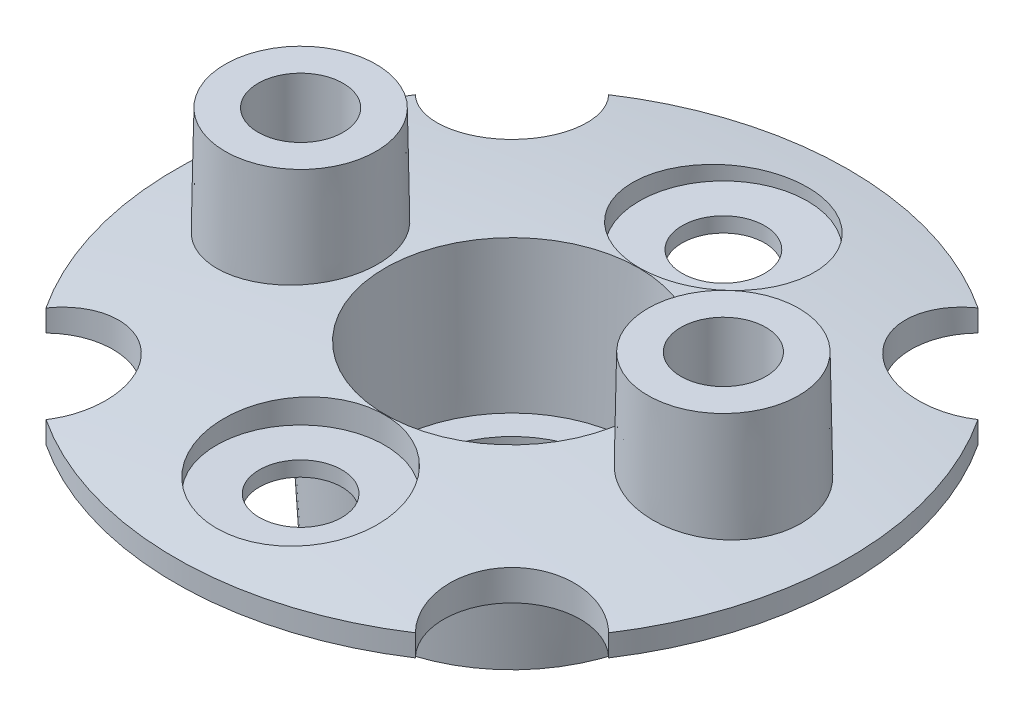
ISO-10303-21;
HEADER;
FILE_DESCRIPTION(('STEP AP214'),'2;1');
FILE_NAME('part.step','',(''),(''),'','','');
FILE_SCHEMA(('AUTOMOTIVE_DESIGN { 1 0 10303 214 1 1 1 1 }'));
ENDSEC;
DATA;
#1=APPLICATION_CONTEXT('core data for automotive mechanical design processes');
#2=APPLICATION_PROTOCOL_DEFINITION('international standard','automotive_design',2000,#1);
#3=PRODUCT_CONTEXT('',#1,'mechanical');
#4=PRODUCT('Part','Part','',(#3));
#5=PRODUCT_RELATED_PRODUCT_CATEGORY('part','',(#4));
#6=PRODUCT_DEFINITION_FORMATION('','',#4);
#7=PRODUCT_DEFINITION_CONTEXT('part definition',#1,'design');
#8=PRODUCT_DEFINITION('design','',#6,#7);
#9=PRODUCT_DEFINITION_SHAPE('','',#8);
#10=(LENGTH_UNIT() NAMED_UNIT(*) SI_UNIT(.MILLI.,.METRE.));
#11=(NAMED_UNIT(*) PLANE_ANGLE_UNIT() SI_UNIT($,.RADIAN.));
#12=(NAMED_UNIT(*) SI_UNIT($,.STERADIAN.) SOLID_ANGLE_UNIT());
#13=UNCERTAINTY_MEASURE_WITH_UNIT(LENGTH_MEASURE(1.E-05),#10,'distance_accuracy_value','');
#14=(GEOMETRIC_REPRESENTATION_CONTEXT(3) GLOBAL_UNCERTAINTY_ASSIGNED_CONTEXT((#13)) GLOBAL_UNIT_ASSIGNED_CONTEXT((#10,
#11,#12)) REPRESENTATION_CONTEXT('',''));
#15=CARTESIAN_POINT('',(0.,0.,0.));
#16=DIRECTION('',(0.,0.,1.));
#17=DIRECTION('',(1.,0.,0.));
#18=AXIS2_PLACEMENT_3D('',#15,#16,#17);
#19=CARTESIAN_POINT('',(0.,-129.34362287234,0.));
#20=DIRECTION('',(0.,1.,0.));
#21=DIRECTION('',(0.,0.,-1.));
#22=AXIS2_PLACEMENT_3D('',#19,#20,#21);
#23=SPHERICAL_SURFACE('',#22,131.68042287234);
#24=CARTESIAN_POINT('',(8.26129199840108,2.04562888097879,-2.88952355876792));
#25=CARTESIAN_POINT('',(8.09938909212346,2.05932952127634,-2.72941756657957));
#26=CARTESIAN_POINT('',(7.95080962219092,2.07190054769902,-2.55551023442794));
#27=CARTESIAN_POINT('',(7.68471117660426,2.0944120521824,-2.18499891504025));
#28=CARTESIAN_POINT('',(7.56722849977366,2.10434945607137,-1.98836878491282));
#29=CARTESIAN_POINT('',(7.36689462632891,2.12129355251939,-1.57813724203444));
#30=CARTESIAN_POINT('',(7.28403140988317,2.128301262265,-1.36454175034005));
#31=CARTESIAN_POINT('',(7.15532090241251,2.13918577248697,-0.926459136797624));
#32=CARTESIAN_POINT('',(7.10946447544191,2.14306334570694,-0.701974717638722));
#33=CARTESIAN_POINT('',(7.05611384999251,2.14757458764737,-0.248897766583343));
#34=CARTESIAN_POINT('',(7.04854612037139,2.14821447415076,-0.0203139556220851));
#35=CARTESIAN_POINT('',(7.07179580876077,2.14624854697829,0.434885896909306));
#36=CARTESIAN_POINT('',(7.10261436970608,2.14364263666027,0.661501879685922));
#37=CARTESIAN_POINT('',(7.20169796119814,2.13526391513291,1.10611417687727));
#38=CARTESIAN_POINT('',(7.26992892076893,2.1294939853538,1.3241181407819));
#39=CARTESIAN_POINT('',(7.44184231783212,2.11495471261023,1.74555870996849));
#40=CARTESIAN_POINT('',(7.54552483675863,2.10618536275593,1.94899528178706));
#41=CARTESIAN_POINT('',(7.78552888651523,2.08588339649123,2.33584650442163));
#42=CARTESIAN_POINT('',(7.92189583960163,2.07434693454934,2.51923276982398));
#43=CARTESIAN_POINT('',(8.22328541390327,2.04884567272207,2.86051508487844));
#44=CARTESIAN_POINT('',(8.38830841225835,2.03488084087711,3.01841079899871));
#45=CARTESIAN_POINT('',(8.74286213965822,2.00487170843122,3.30475571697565));
#46=CARTESIAN_POINT('',(8.93246665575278,1.98882114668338,3.43311289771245));
#47=CARTESIAN_POINT('',(9.33039844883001,1.95512822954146,3.65618741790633));
#48=CARTESIAN_POINT('',(9.53872610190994,1.93748584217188,3.75090408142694));
#49=CARTESIAN_POINT('',(9.96895564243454,1.90104364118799,3.90434025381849));
#50=CARTESIAN_POINT('',(10.1909015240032,1.88224007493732,3.96293552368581));
#51=CARTESIAN_POINT('',(10.6414366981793,1.84406156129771,4.04199461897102));
#52=CARTESIAN_POINT('',(10.8700260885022,1.82468660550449,4.06245788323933));
#53=CARTESIAN_POINT('',(11.3279153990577,1.78586777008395,4.0646890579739));
#54=CARTESIAN_POINT('',(11.5572157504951,1.7664238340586,4.0463685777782));
#55=CARTESIAN_POINT('',(12.0095000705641,1.72806318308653,3.97136070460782));
#56=CARTESIAN_POINT('',(12.2324840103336,1.70914647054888,3.91467313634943));
#57=CARTESIAN_POINT('',(12.6658250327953,1.67237664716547,3.76449772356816));
#58=CARTESIAN_POINT('',(12.8761803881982,1.65452368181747,3.67100485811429));
#59=CARTESIAN_POINT('',(13.2782202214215,1.62039593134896,3.44983225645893));
#60=CARTESIAN_POINT('',(13.4699048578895,1.60412113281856,3.32215281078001));
#61=CARTESIAN_POINT('',(13.8287194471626,1.57365130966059,3.03649739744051));
#62=CARTESIAN_POINT('',(13.9958997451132,1.55945202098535,2.87858512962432));
#63=CARTESIAN_POINT('',(14.3013607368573,1.53350447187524,2.53674838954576));
#64=CARTESIAN_POINT('',(14.4396419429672,1.5217561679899,2.35282437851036));
#65=CARTESIAN_POINT('',(14.6828769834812,1.50108889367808,1.96485248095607));
#66=CARTESIAN_POINT('',(14.7879424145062,1.49216044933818,1.76087506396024));
#67=CARTESIAN_POINT('',(14.9623336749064,1.47733969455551,1.33807234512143));
#68=CARTESIAN_POINT('',(15.0316601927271,1.47144732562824,1.11924732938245));
#69=CARTESIAN_POINT('',(15.1323908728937,1.46288551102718,0.673715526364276));
#70=CARTESIAN_POINT('',(15.1639159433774,1.46020578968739,0.447036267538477));
#71=CARTESIAN_POINT('',(15.1885318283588,1.45811338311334,-0.00841352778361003));
#72=CARTESIAN_POINT('',(15.1816230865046,1.45870066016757,-0.237184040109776));
#73=CARTESIAN_POINT('',(15.1296151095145,1.46312139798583,-0.689937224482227));
#74=CARTESIAN_POINT('',(15.0845768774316,1.46694967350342,-0.913926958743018));
#75=CARTESIAN_POINT('',(14.9576956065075,1.47773378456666,-1.35114634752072));
#76=CARTESIAN_POINT('',(14.8758525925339,1.48468961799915,-1.56437600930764));
#77=CARTESIAN_POINT('',(14.6776520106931,1.50153274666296,-1.9742006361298));
#78=CARTESIAN_POINT('',(14.5612698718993,1.51142212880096,-2.17078363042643));
#79=CARTESIAN_POINT('',(14.2973556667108,1.53384455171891,-2.54161947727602));
#80=CARTESIAN_POINT('',(14.1498231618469,1.54637762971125,-2.71587201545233));
#81=CARTESIAN_POINT('',(13.8273813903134,1.57376477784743,-3.03761441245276));
#82=CARTESIAN_POINT('',(13.652399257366,1.58862502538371,-3.18503071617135));
#83=CARTESIAN_POINT('',(13.2803303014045,1.62021662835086,-3.44841147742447));
#84=CARTESIAN_POINT('',(13.083243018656,1.63694802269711,-3.56437528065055));
#85=CARTESIAN_POINT('',(12.6718141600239,1.67186826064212,-3.7619869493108));
#86=CARTESIAN_POINT('',(12.4574142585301,1.69006202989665,-3.84351251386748));
#87=CARTESIAN_POINT('',(12.0180488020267,1.72733793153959,-3.96939211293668));
#88=CARTESIAN_POINT('',(11.7930834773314,1.74642004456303,-4.01374695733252));
#89=CARTESIAN_POINT('',(11.3383224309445,1.78498533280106,-4.06413247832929));
#90=CARTESIAN_POINT('',(11.108515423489,1.80446944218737,-4.07006059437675));
#91=CARTESIAN_POINT('',(10.6511020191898,1.84324244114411,-4.04314631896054));
#92=CARTESIAN_POINT('',(10.4234961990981,1.86253127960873,-4.01029402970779));
#93=CARTESIAN_POINT('',(9.97673010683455,1.90038511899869,-3.90666429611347));
#94=CARTESIAN_POINT('',(9.75758125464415,1.91894914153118,-3.83583736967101));
#95=CARTESIAN_POINT('',(9.33446509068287,1.95478400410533,-3.65824046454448));
#96=CARTESIAN_POINT('',(9.13047983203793,1.97205637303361,-3.55151382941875));
#97=CARTESIAN_POINT('',(8.8152614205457,1.99874259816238,-3.35096287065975));
#98=CARTESIAN_POINT('',(8.69767115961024,2.00869650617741,-3.26701592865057));
#99=CARTESIAN_POINT('',(8.47203128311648,2.02779471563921,-3.08707124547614));
#100=CARTESIAN_POINT('',(8.36398166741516,2.03693901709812,-2.99107350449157));
#101=CARTESIAN_POINT('',(8.26129199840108,2.04562888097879,-2.88952355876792));
#102=B_SPLINE_CURVE_WITH_KNOTS('',3,(#24,#25,#26,#27,#28,#29,#30,#31,#32,#33,#34,#35,#36,#37,
#38,#39,#40,#41,#42,#43,#44,#45,#46,#47,#48,#49,#50,#51,#52,#53,#54,#55,#56,#57,#58,#59,#60,#61,
#62,#63,#64,#65,#66,#67,#68,#69,#70,#71,#72,#73,#74,#75,#76,#77,#78,#79,#80,#81,#82,#83,#84,#85,
#86,#87,#88,#89,#90,#91,#92,#93,#94,#95,#96,#97,#98,#99,#100,#101),.UNSPECIFIED.,.T.,.F.,(4,2,2,
2,2,2,2,2,2,2,2,2,2,2,2,2,2,2,2,2,2,2,2,2,2,2,2,2,2,2,2,2,2,2,2,2,2,2,4),(0.,0.683804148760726,
1.36840300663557,2.05276397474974,2.73695594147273,3.41983345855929,4.10273130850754,
4.78500828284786,5.46728682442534,6.15051909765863,6.83376036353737,7.5191021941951,
8.20445779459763,8.89215770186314,9.57986772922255,10.2691467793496,10.958428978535,
11.6478052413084,12.3371756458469,13.0251092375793,13.7130306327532,14.3986155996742,
15.0841873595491,15.7675604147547,16.4509255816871,17.1331995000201,17.8154729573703,
18.4982329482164,19.1810025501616,19.8656162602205,20.5502442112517,21.237283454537,
21.9243077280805,22.6131649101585,23.3021979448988,23.9921310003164,24.6812340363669,
25.1149484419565,25.5486628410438),.UNSPECIFIED.);
#103=CARTESIAN_POINT('',(8.26129199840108,2.04562888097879,-2.88952355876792));
#104=VERTEX_POINT('',#103);
#105=EDGE_CURVE('E49',#104,#104,#102,.T.);
#106=ORIENTED_EDGE('',*,*,#105,.F.);
#107=EDGE_LOOP('',(#106));
#108=FACE_BOUND('',#107,.T.);
#109=CARTESIAN_POINT('',(-3.13051581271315,1.52798282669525,-14.2322331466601));
#110=CARTESIAN_POINT('',(-3.30619038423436,1.54295251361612,-14.0559355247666));
#111=CARTESIAN_POINT('',(-3.46701611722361,1.55918918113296,-13.8646863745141));
#112=CARTESIAN_POINT('',(-3.75426571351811,1.59372422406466,-13.4578174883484));
#113=CARTESIAN_POINT('',(-3.8806464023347,1.61202514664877,-13.2421676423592));
#114=CARTESIAN_POINT('',(-4.0952399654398,1.65014221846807,-12.7929102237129));
#115=CARTESIAN_POINT('',(-4.18347593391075,1.66995744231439,-12.5593136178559));
#116=CARTESIAN_POINT('',(-4.3193989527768,1.71054190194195,-12.0807589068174));
#117=CARTESIAN_POINT('',(-4.36709616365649,1.73131089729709,-11.8358036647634));
#118=CARTESIAN_POINT('',(-4.42072287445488,1.77326406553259,-11.3408756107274));
#119=CARTESIAN_POINT('',(-4.42656521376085,1.79444901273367,-11.0908934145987));
#120=CARTESIAN_POINT('',(-4.39608639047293,1.8365923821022,-10.5934816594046));
#121=CARTESIAN_POINT('',(-4.35976318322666,1.85755079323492,-10.3460522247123));
#122=CARTESIAN_POINT('',(-4.24591242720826,1.89866287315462,-9.86058111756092));
#123=CARTESIAN_POINT('',(-4.16835225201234,1.9188158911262,-9.62254703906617));
#124=CARTESIAN_POINT('',(-3.97416927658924,1.95772660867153,-9.16285999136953));
#125=CARTESIAN_POINT('',(-3.85754674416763,1.97648431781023,-8.94120690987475));
#126=CARTESIAN_POINT('',(-3.58870878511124,2.0120428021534,-8.52094358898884));
#127=CARTESIAN_POINT('',(-3.43654652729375,2.02884644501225,-8.32229958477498));
#128=CARTESIAN_POINT('',(-3.10081697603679,2.06004825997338,-7.95338658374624));
#129=CARTESIAN_POINT('',(-2.91725023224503,2.07444647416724,-7.78311709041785));
#130=CARTESIAN_POINT('',(-2.52453147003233,2.10038255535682,-7.47636288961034));
#131=CARTESIAN_POINT('',(-2.31546134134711,2.11192923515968,-7.33977409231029));
#132=CARTESIAN_POINT('',(-1.87721355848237,2.13188835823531,-7.10364934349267));
#133=CARTESIAN_POINT('',(-1.64803627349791,2.14030085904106,-7.00411271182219));
#134=CARTESIAN_POINT('',(-1.17691666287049,2.15372560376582,-6.84526204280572));
#135=CARTESIAN_POINT('',(-0.935020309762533,2.15874929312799,-6.78581261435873));
#136=CARTESIAN_POINT('',(-0.444638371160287,2.16529735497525,-6.70832267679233));
#137=CARTESIAN_POINT('',(-0.196152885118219,2.16682178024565,-6.69028154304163));
#138=CARTESIAN_POINT('',(0.299779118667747,2.16632793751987,-6.69612589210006));
#139=CARTESIAN_POINT('',(0.547226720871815,2.16431735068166,-6.71992047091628));
#140=CARTESIAN_POINT('',(1.03459831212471,2.15682623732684,-6.80856952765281));
#141=CARTESIAN_POINT('',(1.27452232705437,2.15134572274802,-6.87342386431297));
#142=CARTESIAN_POINT('',(1.74004910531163,2.13707211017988,-7.04231529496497));
#143=CARTESIAN_POINT('',(1.96565194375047,2.12827902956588,-7.14635218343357));
#144=CARTESIAN_POINT('',(2.39617821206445,2.10763164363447,-7.39061202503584));
#145=CARTESIAN_POINT('',(2.60110145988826,2.09577731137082,-7.53083529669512));
#146=CARTESIAN_POINT('',(2.98493907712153,2.0693158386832,-7.84379186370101));
#147=CARTESIAN_POINT('',(3.16379644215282,2.05470282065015,-8.01659457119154));
#148=CARTESIAN_POINT('',(3.48997761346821,2.02315537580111,-8.38957844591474));
#149=CARTESIAN_POINT('',(3.63730087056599,2.00622090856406,-8.58976008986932));
#150=CARTESIAN_POINT('',(3.89676311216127,1.97044772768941,-9.01254186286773));
#151=CARTESIAN_POINT('',(4.00878149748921,1.95160277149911,-9.23521547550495));
#152=CARTESIAN_POINT('',(4.19384586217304,1.91258889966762,-9.69609950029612));
#153=CARTESIAN_POINT('',(4.26689112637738,1.89241995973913,-9.93431019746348));
#154=CARTESIAN_POINT('',(4.37215602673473,1.85126117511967,-10.4203097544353));
#155=CARTESIAN_POINT('',(4.40424670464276,1.83026895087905,-10.6681263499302));
#156=CARTESIAN_POINT('',(4.42628965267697,1.78811713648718,-11.1656137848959));
#157=CARTESIAN_POINT('',(4.4162414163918,1.76695754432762,-11.4152846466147));
#158=CARTESIAN_POINT('',(4.3542363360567,1.72503772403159,-11.9097957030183));
#159=CARTESIAN_POINT('',(4.30221526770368,1.70427815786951,-12.1546279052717));
#160=CARTESIAN_POINT('',(4.15763018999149,1.66378323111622,-12.6321042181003));
#161=CARTESIAN_POINT('',(4.06506624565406,1.64404786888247,-12.8647483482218));
#162=CARTESIAN_POINT('',(3.84206600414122,1.60618082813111,-13.3110384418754));
#163=CARTESIAN_POINT('',(3.71165855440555,1.58804794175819,-13.5246987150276));
#164=CARTESIAN_POINT('',(3.41660201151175,1.55389122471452,-13.9270936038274));
#165=CARTESIAN_POINT('',(3.25195329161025,1.53786737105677,-14.1158284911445));
#166=CARTESIAN_POINT('',(2.89355803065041,1.50843414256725,-14.4624500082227));
#167=CARTESIAN_POINT('',(2.69989234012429,1.49501773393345,-14.6204196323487));
#168=CARTESIAN_POINT('',(2.2886142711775,1.47113548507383,-14.9015837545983));
#169=CARTESIAN_POINT('',(2.07100230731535,1.46066959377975,-15.0247788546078));
#170=CARTESIAN_POINT('',(1.61882488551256,1.44302602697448,-15.2324457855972));
#171=CARTESIAN_POINT('',(1.38432122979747,1.43583700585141,-15.3170512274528));
#172=CARTESIAN_POINT('',(0.904374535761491,1.4249044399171,-15.4457077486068));
#173=CARTESIAN_POINT('',(0.658932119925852,1.42116069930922,-15.4897611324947));
#174=CARTESIAN_POINT('',(0.164811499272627,1.41723360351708,-15.5359719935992));
#175=CARTESIAN_POINT('',(-0.0838555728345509,1.41704019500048,-15.5382477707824));
#176=CARTESIAN_POINT('',(-0.578104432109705,1.4201945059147,-15.5011305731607));
#177=CARTESIAN_POINT('',(-0.8236854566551,1.42354308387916,-15.4617274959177));
#178=CARTESIAN_POINT('',(-1.30463293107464,1.43368162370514,-15.3424168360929));
#179=CARTESIAN_POINT('',(-1.54000203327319,1.44047068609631,-15.2625198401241));
#180=CARTESIAN_POINT('',(-1.99375361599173,1.45728817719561,-15.0645803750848));
#181=CARTESIAN_POINT('',(-2.21215618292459,1.46731270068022,-14.9465838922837));
#182=CARTESIAN_POINT('',(-2.54726474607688,1.48592670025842,-14.7274496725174));
#183=CARTESIAN_POINT('',(-2.67109528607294,1.49361560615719,-14.6369248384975));
#184=CARTESIAN_POINT('',(-2.90866379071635,1.51003732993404,-14.4435653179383));
#185=CARTESIAN_POINT('',(-3.02240176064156,1.51877014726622,-14.3407306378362));
#186=CARTESIAN_POINT('',(-3.13051581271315,1.52798282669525,-14.2322331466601));
#187=B_SPLINE_CURVE_WITH_KNOTS('',3,(#109,#110,#111,#112,#113,#114,#115,#116,#117,#118,#119,
#120,#121,#122,#123,#124,#125,#126,#127,#128,#129,#130,#131,#132,#133,#134,#135,#136,#137,#138,
#139,#140,#141,#142,#143,#144,#145,#146,#147,#148,#149,#150,#151,#152,#153,#154,#155,#156,#157,
#158,#159,#160,#161,#162,#163,#164,#165,#166,#167,#168,#169,#170,#171,#172,#173,#174,#175,#176,
#177,#178,#179,#180,#181,#182,#183,#184,#185,#186),.UNSPECIFIED.,.T.,.F.,(4,2,2,2,2,2,2,2,2,2,2,
2,2,2,2,2,2,2,2,2,2,2,2,2,2,2,2,2,2,2,2,2,2,2,2,2,2,2,4),(0.,0.747433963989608,1.49580052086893,
2.24371335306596,2.99143867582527,3.74072064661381,4.49003895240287,5.23995099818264,
5.989857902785,6.73865002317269,7.48742903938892,8.23386411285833,8.98028548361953,
9.72417308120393,10.4680494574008,11.2103114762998,11.9525709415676,12.6948265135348,
13.4370886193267,14.180950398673,14.9248251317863,15.6712140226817,16.4176166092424,
17.1663637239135,17.9151198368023,18.6650238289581,19.4149266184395,20.1642592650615,
20.9135837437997,21.6608579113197,22.4081191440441,23.15277308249,23.8973846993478,
24.6398875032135,25.3825703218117,26.1250590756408,26.8666549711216,27.326642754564,
27.7866302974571),.UNSPECIFIED.);
#188=CARTESIAN_POINT('',(-3.13051581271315,1.52798282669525,-14.2322331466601));
#189=VERTEX_POINT('',#188);
#190=EDGE_CURVE('E238',#189,#189,#187,.T.);
#191=ORIENTED_EDGE('',*,*,#190,.F.);
#192=EDGE_LOOP('',(#191));
#193=FACE_BOUND('',#192,.T.);
#194=CARTESIAN_POINT('',(0.,2.1676136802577,0.));
#195=DIRECTION('',(0.,-1.,0.));
#196=DIRECTION('',(0.,0.,-1.));
#197=AXIS2_PLACEMENT_3D('',#194,#195,#196);
#198=CIRCLE('',#197,6.67296247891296);
#199=CARTESIAN_POINT('',(0.,2.1676136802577,-6.67296247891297));
#200=VERTEX_POINT('',#199);
#201=EDGE_CURVE('E244',#200,#200,#198,.T.);
#202=ORIENTED_EDGE('',*,*,#201,.T.);
#203=EDGE_LOOP('',(#202));
#204=FACE_BOUND('',#203,.T.);
#205=CARTESIAN_POINT('',(0.,1.143,0.));
#206=DIRECTION('',(0.,1.,0.));
#207=DIRECTION('',(0.,0.,1.));
#208=AXIS2_PLACEMENT_3D('',#205,#206,#207);
#209=CIRCLE('',#208,17.6911);
#210=CARTESIAN_POINT('',(-14.7898284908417,1.14299999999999,-9.70752246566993));
#211=VERTEX_POINT('',#210);
#212=CARTESIAN_POINT('',(-14.7898284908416,1.14299999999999,9.70752246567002));
#213=VERTEX_POINT('',#212);
#214=EDGE_CURVE('E141',#211,#213,#209,.T.);
#215=ORIENTED_EDGE('',*,*,#214,.T.);
#216=CARTESIAN_POINT('',(-15.878977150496,0.800032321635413,12.256462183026));
#217=CARTESIAN_POINT('',(-15.8781834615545,0.809660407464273,12.155258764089));
#218=CARTESIAN_POINT('',(-15.8730962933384,0.819685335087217,12.0541333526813));
#219=CARTESIAN_POINT('',(-15.8544342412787,0.840452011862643,11.8527483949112));
#220=CARTESIAN_POINT('',(-15.8408598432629,0.8511937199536,11.7524887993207));
#221=CARTESIAN_POINT('',(-15.8052996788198,0.873332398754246,11.553406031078));
#222=CARTESIAN_POINT('',(-15.7833031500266,0.884730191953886,11.4545848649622));
#223=CARTESIAN_POINT('',(-15.731091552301,0.908081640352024,11.2592347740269));
#224=CARTESIAN_POINT('',(-15.7008767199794,0.920035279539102,11.1627057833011));
#225=CARTESIAN_POINT('',(-15.5975120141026,0.956854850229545,10.8756181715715));
#226=CARTESIAN_POINT('',(-15.5119823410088,0.982467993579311,10.6894593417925));
#227=CARTESIAN_POINT('',(-15.3109169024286,1.03482990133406,10.3349283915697));
#228=CARTESIAN_POINT('',(-15.1954605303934,1.06157550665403,10.1665108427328));
#229=CARTESIAN_POINT('',(-15.0237123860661,1.09752689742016,9.95655623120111));
#230=CARTESIAN_POINT('',(-14.9791339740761,1.10656906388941,9.9051222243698));
#231=CARTESIAN_POINT('',(-14.8871305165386,1.12467431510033,9.80485875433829));
#232=CARTESIAN_POINT('',(-14.8397050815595,1.1337374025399,9.75602964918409));
#233=CARTESIAN_POINT('',(-14.645365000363,1.16982848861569,9.56702399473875));
#234=CARTESIAN_POINT('',(-14.4876025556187,1.19685261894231,9.43765648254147));
#235=CARTESIAN_POINT('',(-14.1521752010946,1.25009536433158,9.2072105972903));
#236=CARTESIAN_POINT('',(-13.9744707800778,1.27631224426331,9.1061898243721));
#237=CARTESIAN_POINT('',(-13.6044163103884,1.32714657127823,8.93564402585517));
#238=CARTESIAN_POINT('',(-13.4120749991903,1.35176495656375,8.866100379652));
#239=CARTESIAN_POINT('',(-13.0182223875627,1.3986963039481,8.76057846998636));
#240=CARTESIAN_POINT('',(-12.8167152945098,1.42101030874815,8.72458496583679));
#241=CARTESIAN_POINT('',(-12.4110176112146,1.46261578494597,8.6873526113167));
#242=CARTESIAN_POINT('',(-12.2068408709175,1.48191891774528,8.68597618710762));
#243=CARTESIAN_POINT('',(-11.800882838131,1.51704413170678,8.71782801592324));
#244=CARTESIAN_POINT('',(-11.5991016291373,1.53286609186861,8.75105747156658));
#245=CARTESIAN_POINT('',(-11.2054921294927,1.5604401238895,8.85087972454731));
#246=CARTESIAN_POINT('',(-11.0135944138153,1.57222530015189,8.91718962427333));
#247=CARTESIAN_POINT('',(-10.6435087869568,1.59155855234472,9.08123395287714));
#248=CARTESIAN_POINT('',(-10.4653201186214,1.59910686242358,9.17896664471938));
#249=CARTESIAN_POINT('',(-10.1291277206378,1.60970001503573,9.40224464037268));
#250=CARTESIAN_POINT('',(-9.97098075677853,1.61277867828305,9.52757272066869));
#251=CARTESIAN_POINT('',(-9.67784046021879,1.6144493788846,9.80290345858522));
#252=CARTESIAN_POINT('',(-9.54284647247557,1.61304154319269,9.95290541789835));
#253=CARTESIAN_POINT('',(-9.30028706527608,1.60579425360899,10.2727179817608));
#254=CARTESIAN_POINT('',(-9.19262693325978,1.59997038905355,10.44245713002));
#255=CARTESIAN_POINT('',(-9.00711071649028,1.58408101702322,10.7973251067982));
#256=CARTESIAN_POINT('',(-8.92925513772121,1.57401543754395,10.9824541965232));
#257=CARTESIAN_POINT('',(-8.80531817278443,1.54991060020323,11.3632458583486));
#258=CARTESIAN_POINT('',(-8.75930467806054,1.53586294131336,11.5589299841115));
#259=CARTESIAN_POINT('',(-8.70048515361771,1.50421028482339,11.9549236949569));
#260=CARTESIAN_POINT('',(-8.6876769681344,1.48660551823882,12.1552329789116));
#261=CARTESIAN_POINT('',(-8.69549575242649,1.44821393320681,12.5562093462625));
#262=CARTESIAN_POINT('',(-8.71634194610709,1.42740705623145,12.7568702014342));
#263=CARTESIAN_POINT('',(-8.791182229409,1.38327383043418,13.1517391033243));
#264=CARTESIAN_POINT('',(-8.84519423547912,1.35994612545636,13.3459436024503));
#265=CARTESIAN_POINT('',(-8.98537677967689,1.31121277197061,13.7241531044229));
#266=CARTESIAN_POINT('',(-9.0718432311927,1.28578973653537,13.9080457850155));
#267=CARTESIAN_POINT('',(-9.27427509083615,1.23380334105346,14.2582881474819));
#268=CARTESIAN_POINT('',(-9.39017725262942,1.20724252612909,14.4246743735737));
#269=CARTESIAN_POINT('',(-9.54918490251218,1.17423733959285,14.6163364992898));
#270=CARTESIAN_POINT('',(-9.58010331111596,1.16795730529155,14.6521366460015));
#271=CARTESIAN_POINT('',(-9.64331430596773,1.15538572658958,14.7224754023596));
#272=CARTESIAN_POINT('',(-9.67560617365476,1.14909418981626,14.7570146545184));
#273=CARTESIAN_POINT('',(-9.77032409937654,1.13100834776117,14.8543975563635));
#274=CARTESIAN_POINT('',(-9.83443574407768,1.11920738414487,14.9156141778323));
#275=CARTESIAN_POINT('',(-9.96706126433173,1.09564477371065,15.0331937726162));
#276=CARTESIAN_POINT('',(-10.0355789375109,1.08388317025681,15.0895524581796));
#277=CARTESIAN_POINT('',(-10.1869888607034,1.05874829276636,15.2049709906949));
#278=CARTESIAN_POINT('',(-10.2705130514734,1.04539242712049,15.2632087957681));
#279=CARTESIAN_POINT('',(-10.4422691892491,1.01891637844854,15.3724325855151));
#280=CARTESIAN_POINT('',(-10.5305035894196,1.00579632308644,15.4234147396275));
#281=CARTESIAN_POINT('',(-10.7113436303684,0.97984637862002,15.5178882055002));
#282=CARTESIAN_POINT('',(-10.803963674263,0.967017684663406,15.5613522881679));
#283=CARTESIAN_POINT('',(-10.9925772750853,0.94179680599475,15.6402384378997));
#284=CARTESIAN_POINT('',(-11.0885693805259,0.929404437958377,15.6756639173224));
#285=CARTESIAN_POINT('',(-11.1859342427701,0.917273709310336,15.7069241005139));
#286=B_SPLINE_CURVE_WITH_KNOTS('',3,(#216,#217,#218,#219,#220,#221,#222,#223,#224,#225,#226,
#227,#228,#229,#230,#231,#232,#233,#234,#235,#236,#237,#238,#239,#240,#241,#242,#243,#244,#245,
#246,#247,#248,#249,#250,#251,#252,#253,#254,#255,#256,#257,#258,#259,#260,#261,#262,#263,#264,
#265,#266,#267,#268,#269,#270,#271,#272,#273,#274,#275,#276,#277,#278,#279,#280,#281,#282,#283,
#284,#285),.UNSPECIFIED.,.F.,.F.,(4,2,2,2,2,2,2,2,2,2,2,2,2,2,2,2,2,2,2,2,2,2,2,2,2,2,2,2,2,2,2,
2,2,2,4),(0.,0.304888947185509,0.609760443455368,0.915022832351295,1.22027643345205,
1.83653602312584,2.45117716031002,2.65708112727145,2.86301332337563,3.47719000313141,
4.09260578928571,4.7076570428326,5.3224287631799,5.93475689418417,6.54710630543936,
7.15430655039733,7.76147323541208,8.36402125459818,8.96655222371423,9.56696600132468,
10.1673899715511,10.7690902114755,11.3707513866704,11.9763476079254,12.5822712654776,
13.1938593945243,13.8041444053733,13.9472830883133,14.0903477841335,14.358367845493,
14.6266220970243,14.9343340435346,15.2422078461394,15.5511743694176,15.8600094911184),.UNSPECIFIED.);
#287=CARTESIAN_POINT('',(-9.70752246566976,1.14300000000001,14.7898284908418));
#288=VERTEX_POINT('',#287);
#289=EDGE_CURVE('E176',#213,#288,#286,.T.);
#290=ORIENTED_EDGE('',*,*,#289,.T.);
#291=CARTESIAN_POINT('',(9.70752246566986,1.143,14.7898284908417));
#292=VERTEX_POINT('',#291);
#293=EDGE_CURVE('E120',#288,#292,#209,.T.);
#294=ORIENTED_EDGE('',*,*,#293,.T.);
#295=CARTESIAN_POINT('',(12.2564621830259,0.800032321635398,15.8789771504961));
#296=CARTESIAN_POINT('',(12.1552587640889,0.809660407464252,15.8781834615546));
#297=CARTESIAN_POINT('',(12.0541333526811,0.819685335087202,15.8730962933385));
#298=CARTESIAN_POINT('',(11.8527483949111,0.840452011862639,15.8544342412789));
#299=CARTESIAN_POINT('',(11.7524887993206,0.8511937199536,15.840859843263));
#300=CARTESIAN_POINT('',(11.5534060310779,0.873332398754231,15.8052996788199));
#301=CARTESIAN_POINT('',(11.4545848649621,0.884730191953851,15.7833031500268));
#302=CARTESIAN_POINT('',(11.2592347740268,0.908081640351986,15.7310915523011));
#303=CARTESIAN_POINT('',(11.162705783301,0.92003527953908,15.7008767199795));
#304=CARTESIAN_POINT('',(10.8756181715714,0.956854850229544,15.5975120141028));
#305=CARTESIAN_POINT('',(10.6894593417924,0.982467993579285,15.511982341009));
#306=CARTESIAN_POINT('',(10.3349283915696,1.03482990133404,15.3109169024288));
#307=CARTESIAN_POINT('',(10.1665108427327,1.06157550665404,15.1954605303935));
#308=CARTESIAN_POINT('',(9.95655623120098,1.09752689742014,15.0237123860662));
#309=CARTESIAN_POINT('',(9.90512222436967,1.10656906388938,14.9791339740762));
#310=CARTESIAN_POINT('',(9.80485875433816,1.1246743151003,14.8871305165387));
#311=CARTESIAN_POINT('',(9.75602964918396,1.13373740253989,14.8397050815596));
#312=CARTESIAN_POINT('',(9.56702399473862,1.16982848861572,14.6453650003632));
#313=CARTESIAN_POINT('',(9.43765648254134,1.1968526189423,14.4876025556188));
#314=CARTESIAN_POINT('',(9.20721059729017,1.25009536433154,14.1521752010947));
#315=CARTESIAN_POINT('',(9.10618982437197,1.2763122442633,13.974470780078));
#316=CARTESIAN_POINT('',(8.93564402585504,1.32714657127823,13.6044163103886));
#317=CARTESIAN_POINT('',(8.86610037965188,1.35176495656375,13.4120749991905));
#318=CARTESIAN_POINT('',(8.76057846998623,1.3986963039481,13.0182223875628));
#319=CARTESIAN_POINT('',(8.72458496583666,1.42101030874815,12.8167152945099));
#320=CARTESIAN_POINT('',(8.68735261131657,1.46261578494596,12.4110176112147));
#321=CARTESIAN_POINT('',(8.6859761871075,1.48191891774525,12.2068408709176));
#322=CARTESIAN_POINT('',(8.71782801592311,1.51704413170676,11.8008828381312));
#323=CARTESIAN_POINT('',(8.75105747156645,1.53286609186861,11.5991016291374));
#324=CARTESIAN_POINT('',(8.85087972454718,1.5604401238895,11.2054921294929));
#325=CARTESIAN_POINT('',(8.9171896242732,1.57222530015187,11.0135944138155));
#326=CARTESIAN_POINT('',(9.08123395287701,1.59155855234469,10.643508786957));
#327=CARTESIAN_POINT('',(9.17896664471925,1.59910686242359,10.4653201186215));
#328=CARTESIAN_POINT('',(9.40224464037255,1.60970001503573,10.129127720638));
#329=CARTESIAN_POINT('',(9.52757272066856,1.61277867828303,9.97098075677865));
#330=CARTESIAN_POINT('',(9.80290345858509,1.61444937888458,9.67784046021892));
#331=CARTESIAN_POINT('',(9.95290541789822,1.61304154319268,9.5428464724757));
#332=CARTESIAN_POINT('',(10.2727179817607,1.60579425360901,9.3002870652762));
#333=CARTESIAN_POINT('',(10.4424571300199,1.59997038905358,9.1926269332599));
#334=CARTESIAN_POINT('',(10.797325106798,1.58408101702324,9.00711071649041));
#335=CARTESIAN_POINT('',(10.9824541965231,1.57401543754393,8.92925513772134));
#336=CARTESIAN_POINT('',(11.3632458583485,1.5499106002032,8.80531817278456));
#337=CARTESIAN_POINT('',(11.5589299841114,1.53586294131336,8.75930467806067));
#338=CARTESIAN_POINT('',(11.9549236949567,1.50421028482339,8.70048515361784));
#339=CARTESIAN_POINT('',(12.1552329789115,1.4866055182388,8.68767696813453));
#340=CARTESIAN_POINT('',(12.5562093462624,1.44821393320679,8.69549575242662));
#341=CARTESIAN_POINT('',(12.756870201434,1.42740705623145,8.71634194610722));
#342=CARTESIAN_POINT('',(13.1517391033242,1.38327383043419,8.79118222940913));
#343=CARTESIAN_POINT('',(13.3459436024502,1.35994612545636,8.84519423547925));
#344=CARTESIAN_POINT('',(13.7241531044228,1.31121277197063,8.98537677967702));
#345=CARTESIAN_POINT('',(13.9080457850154,1.28578973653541,9.07184323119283));
#346=CARTESIAN_POINT('',(14.2582881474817,1.23380334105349,9.27427509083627));
#347=CARTESIAN_POINT('',(14.4246743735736,1.20724252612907,9.39017725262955));
#348=CARTESIAN_POINT('',(14.6163364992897,1.17423733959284,9.54918490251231));
#349=CARTESIAN_POINT('',(14.6521366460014,1.16795730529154,9.5801033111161));
#350=CARTESIAN_POINT('',(14.7224754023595,1.15538572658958,9.64331430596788));
#351=CARTESIAN_POINT('',(14.7570146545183,1.14909418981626,9.67560617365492));
#352=CARTESIAN_POINT('',(14.8543975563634,1.13100834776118,9.77032409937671));
#353=CARTESIAN_POINT('',(14.9156141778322,1.11920738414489,9.83443574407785));
#354=CARTESIAN_POINT('',(15.0331937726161,1.09564477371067,9.96706126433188));
#355=CARTESIAN_POINT('',(15.0895524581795,1.08388317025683,10.035578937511));
#356=CARTESIAN_POINT('',(15.2049709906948,1.05874829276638,10.1869888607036));
#357=CARTESIAN_POINT('',(15.263208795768,1.04539242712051,10.2705130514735));
#358=CARTESIAN_POINT('',(15.3724325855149,1.01891637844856,10.4422691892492));
#359=CARTESIAN_POINT('',(15.4234147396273,1.00579632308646,10.5305035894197));
#360=CARTESIAN_POINT('',(15.5178882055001,0.979846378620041,10.7113436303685));
#361=CARTESIAN_POINT('',(15.5613522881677,0.967017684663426,10.8039636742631));
#362=CARTESIAN_POINT('',(15.6402384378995,0.94179680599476,10.9925772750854));
#363=CARTESIAN_POINT('',(15.6756639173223,0.929404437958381,11.088569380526));
#364=CARTESIAN_POINT('',(15.7069241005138,0.91727370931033,11.1859342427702));
#365=B_SPLINE_CURVE_WITH_KNOTS('',3,(#295,#296,#297,#298,#299,#300,#301,#302,#303,#304,#305,
#306,#307,#308,#309,#310,#311,#312,#313,#314,#315,#316,#317,#318,#319,#320,#321,#322,#323,#324,
#325,#326,#327,#328,#329,#330,#331,#332,#333,#334,#335,#336,#337,#338,#339,#340,#341,#342,#343,
#344,#345,#346,#347,#348,#349,#350,#351,#352,#353,#354,#355,#356,#357,#358,#359,#360,#361,#362,
#363,#364),.UNSPECIFIED.,.F.,.F.,(4,2,2,2,2,2,2,2,2,2,2,2,2,2,2,2,2,2,2,2,2,2,2,2,2,2,2,2,2,2,2,
2,2,2,4),(0.,0.304888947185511,0.609760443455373,0.915022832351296,1.22027643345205,
1.83653602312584,2.45117716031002,2.65708112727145,2.86301332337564,3.47719000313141,
4.09260578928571,4.70765704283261,5.3224287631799,5.93475689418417,6.54710630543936,
7.15430655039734,7.76147323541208,8.36402125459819,8.96655222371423,9.56696600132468,
10.1673899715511,10.7690902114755,11.3707513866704,11.9763476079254,12.5822712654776,
13.1938593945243,13.8041444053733,13.9472830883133,14.0903477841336,14.3583678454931,
14.6266220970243,14.9343340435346,15.2422078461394,15.5511743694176,15.8600094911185),.UNSPECIFIED.);
#366=CARTESIAN_POINT('',(14.7898284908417,1.14300000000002,9.70752246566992));
#367=VERTEX_POINT('',#366);
#368=EDGE_CURVE('E213',#292,#367,#365,.T.);
#369=ORIENTED_EDGE('',*,*,#368,.T.);
#370=CARTESIAN_POINT('',(14.7898284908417,1.143,-9.70752246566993));
#371=VERTEX_POINT('',#370);
#372=EDGE_CURVE('E142',#367,#371,#209,.T.);
#373=ORIENTED_EDGE('',*,*,#372,.T.);
#374=CARTESIAN_POINT('',(15.7069241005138,0.917273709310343,-11.1859342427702));
#375=CARTESIAN_POINT('',(15.6756721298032,0.929401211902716,-11.0885953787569));
#376=CARTESIAN_POINT('',(15.6402573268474,0.941790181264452,-10.9926286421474));
#377=CARTESIAN_POINT('',(15.5613981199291,0.967003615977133,-10.8040670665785));
#378=CARTESIAN_POINT('',(15.5179505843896,0.979828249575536,-10.7114735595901));
#379=CARTESIAN_POINT('',(15.4236344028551,1.00573697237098,-10.5309136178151));
#380=CARTESIAN_POINT('',(15.3728124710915,1.01881901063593,-10.44292247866));
#381=CARTESIAN_POINT('',(15.2639497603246,1.04521804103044,-10.2716229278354));
#382=CARTESIAN_POINT('',(15.2059125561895,1.05853491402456,-10.1883122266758));
#383=CARTESIAN_POINT('',(15.0905967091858,1.08366292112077,-10.0368730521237));
#384=CARTESIAN_POINT('',(15.0341078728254,1.09545712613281,-9.96813957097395));
#385=CARTESIAN_POINT('',(14.9161649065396,1.11910143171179,-9.83501026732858));
#386=CARTESIAN_POINT('',(14.8547067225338,1.13095157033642,-9.77061806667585));
#387=CARTESIAN_POINT('',(14.6453142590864,1.16983759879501,-9.56697794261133));
#388=CARTESIAN_POINT('',(14.4875225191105,1.19686629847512,-9.43759116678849));
#389=CARTESIAN_POINT('',(14.1520942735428,1.25010723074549,-9.20716536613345));
#390=CARTESIAN_POINT('',(13.974427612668,1.27631814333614,-9.10617025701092));
#391=CARTESIAN_POINT('',(13.6044244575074,1.32714548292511,-8.93564745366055));
#392=CARTESIAN_POINT('',(13.4120939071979,1.35176254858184,-8.86610708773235));
#393=CARTESIAN_POINT('',(13.01824278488,1.39869402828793,-8.76058229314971));
#394=CARTESIAN_POINT('',(12.8167255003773,1.42100925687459,-8.72458595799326));
#395=CARTESIAN_POINT('',(12.411015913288,1.46261596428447,-8.68735240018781));
#396=CARTESIAN_POINT('',(12.2068376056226,1.48191922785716,-8.68597615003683));
#397=CARTESIAN_POINT('',(11.8008796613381,1.51704437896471,-8.71782855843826));
#398=CARTESIAN_POINT('',(11.599100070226,1.53286620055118,-8.75105787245));
#399=CARTESIAN_POINT('',(11.2054921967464,1.56044011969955,-8.85087970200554));
#400=CARTESIAN_POINT('',(11.0135945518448,1.57222529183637,-8.91718957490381));
#401=CARTESIAN_POINT('',(10.6435089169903,1.59155854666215,-9.08123388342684));
#402=CARTESIAN_POINT('',(10.4653201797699,1.59910686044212,-9.17896660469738));
#403=CARTESIAN_POINT('',(10.1291278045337,1.60970001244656,-9.40224458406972));
#404=CARTESIAN_POINT('',(9.97098091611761,1.61277867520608,-9.5275725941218));
#405=CARTESIAN_POINT('',(9.67784059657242,1.61444938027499,-9.80290330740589));
#406=CARTESIAN_POINT('',(9.54284653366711,1.61304154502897,-9.95290533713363));
#407=CARTESIAN_POINT('',(9.30028704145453,1.60579425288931,-10.2727180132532));
#408=CARTESIAN_POINT('',(9.19262689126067,1.5999703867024,-10.4424571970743));
#409=CARTESIAN_POINT('',(9.00711068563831,1.58408101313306,-10.7973251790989));
#410=CARTESIAN_POINT('',(8.92925512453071,1.57401543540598,-10.9824542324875));
#411=CARTESIAN_POINT('',(8.80531803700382,1.54991057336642,-11.3632462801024));
#412=CARTESIAN_POINT('',(8.75930447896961,1.53586287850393,-11.5589308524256));
#413=CARTESIAN_POINT('',(8.7004850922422,1.50421020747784,-11.9549245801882));
#414=CARTESIAN_POINT('',(8.68767696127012,1.48660547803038,-12.1552334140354));
#415=CARTESIAN_POINT('',(8.69549570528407,1.44821423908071,-12.5562061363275));
#416=CARTESIAN_POINT('',(8.71634133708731,1.42740771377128,-12.7568638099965));
#417=CARTESIAN_POINT('',(8.79118043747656,1.3832745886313,-13.1517328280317));
#418=CARTESIAN_POINT('',(8.84519288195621,1.35994655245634,-13.3459404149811));
#419=CARTESIAN_POINT('',(8.98538273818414,1.31121074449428,-13.7241687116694));
#420=CARTESIAN_POINT('',(9.07185817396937,1.2857854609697,-13.9080763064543));
#421=CARTESIAN_POINT('',(9.27429315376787,1.23379913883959,-14.2583147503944));
#422=CARTESIAN_POINT('',(9.39018463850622,1.20724083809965,-14.4246849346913));
#423=CARTESIAN_POINT('',(9.54917826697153,1.17423875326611,-14.6163281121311));
#424=CARTESIAN_POINT('',(9.58008999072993,1.16796009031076,-14.6521203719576));
#425=CARTESIAN_POINT('',(9.64329680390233,1.15538907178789,-14.7224573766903));
#426=CARTESIAN_POINT('',(9.67559185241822,1.14909671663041,-14.7570021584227));
#427=CARTESIAN_POINT('',(9.85012611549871,1.11577150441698,-14.9364353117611));
#428=CARTESIAN_POINT('',(10.0042628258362,1.08866264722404,-15.0701482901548));
#429=CARTESIAN_POINT('',(10.3332935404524,1.03508057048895,-15.3098930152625));
#430=CARTESIAN_POINT('',(10.5082409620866,1.00860920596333,-15.4158511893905));
#431=CARTESIAN_POINT('',(10.8737011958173,0.95711299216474,-15.5966934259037));
#432=CARTESIAN_POINT('',(11.0642122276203,0.932087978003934,-15.6715810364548));
#433=CARTESIAN_POINT('',(11.4551640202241,0.884243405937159,-15.7879019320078));
#434=CARTESIAN_POINT('',(11.655583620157,0.861419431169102,-15.8294034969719));
#435=CARTESIAN_POINT('',(11.9240996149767,0.833046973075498,-15.8615496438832));
#436=CARTESIAN_POINT('',(11.9904583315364,0.826211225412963,-15.8676231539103));
#437=CARTESIAN_POINT('',(12.1233459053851,0.81287205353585,-15.8760680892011));
#438=CARTESIAN_POINT('',(12.1898743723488,0.806368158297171,-15.8784449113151));
#439=CARTESIAN_POINT('',(12.2564621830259,0.800032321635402,-15.8789771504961));
#440=B_SPLINE_CURVE_WITH_KNOTS('',3,(#374,#375,#376,#377,#378,#379,#380,#381,#382,#383,#384,
#385,#386,#387,#388,#389,#390,#391,#392,#393,#394,#395,#396,#397,#398,#399,#400,#401,#402,#403,
#404,#405,#406,#407,#408,#409,#410,#411,#412,#413,#414,#415,#416,#417,#418,#419,#420,#421,#422,
#423,#424,#425,#426,#427,#428,#429,#430,#431,#432,#433,#434,#435,#436,#437,#438,#439),
.UNSPECIFIED.,.F.,.F.,(4,2,2,2,2,2,2,2,2,2,2,2,2,2,2,2,2,2,2,2,2,2,2,2,2,2,2,2,2,2,2,2,4),(0.,
0.308752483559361,0.617625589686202,0.924621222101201,1.23146535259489,1.50045288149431,
1.76966211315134,2.38398581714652,2.99925458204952,3.61427526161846,4.22907755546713,
4.84141052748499,5.45375509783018,6.06095512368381,6.66812202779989,7.27066974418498,
7.8732010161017,8.47361491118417,9.0740387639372,9.67574033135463,10.2774001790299,
10.8829867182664,11.488920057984,12.1005578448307,12.7107931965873,12.8538969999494,
12.9969965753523,13.6112478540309,14.2271112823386,14.8429043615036,15.4574348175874,
15.6583176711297,15.85890697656),.UNSPECIFIED.);
#441=CARTESIAN_POINT('',(9.70752246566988,1.14299999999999,-14.7898284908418));
#442=VERTEX_POINT('',#441);
#443=EDGE_CURVE('E194',#371,#442,#440,.T.);
#444=ORIENTED_EDGE('',*,*,#443,.T.);
#445=CARTESIAN_POINT('',(-9.70752246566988,1.143,-14.7898284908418));
#446=VERTEX_POINT('',#445);
#447=EDGE_CURVE('E604',#442,#446,#209,.T.);
#448=ORIENTED_EDGE('',*,*,#447,.T.);
#449=CARTESIAN_POINT('',(-11.1859342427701,0.917273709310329,-15.7069241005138));
#450=CARTESIAN_POINT('',(-11.0885953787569,0.929401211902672,-15.6756721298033));
#451=CARTESIAN_POINT('',(-10.9926286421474,0.941790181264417,-15.6402573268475));
#452=CARTESIAN_POINT('',(-10.8040670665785,0.96700361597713,-15.5613981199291));
#453=CARTESIAN_POINT('',(-10.71147355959,0.979828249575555,-15.5179505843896));
#454=CARTESIAN_POINT('',(-10.530913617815,1.005736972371,-15.4236344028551));
#455=CARTESIAN_POINT('',(-10.44292247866,1.01881901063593,-15.3728124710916));
#456=CARTESIAN_POINT('',(-10.2716229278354,1.04521804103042,-15.2639497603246));
#457=CARTESIAN_POINT('',(-10.1883122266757,1.05853491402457,-15.2059125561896));
#458=CARTESIAN_POINT('',(-10.0368730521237,1.08366292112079,-15.0905967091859));
#459=CARTESIAN_POINT('',(-9.9681395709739,1.09545712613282,-15.0341078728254));
#460=CARTESIAN_POINT('',(-9.83501026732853,1.1191014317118,-14.9161649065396));
#461=CARTESIAN_POINT('',(-9.7706180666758,1.13095157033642,-14.8547067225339));
#462=CARTESIAN_POINT('',(-9.56697794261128,1.169837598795,-14.6453142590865));
#463=CARTESIAN_POINT('',(-9.43759116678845,1.19686629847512,-14.4875225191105));
#464=CARTESIAN_POINT('',(-9.20716536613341,1.25010723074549,-14.1520942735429));
#465=CARTESIAN_POINT('',(-9.10617025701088,1.27631814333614,-13.974427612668));
#466=CARTESIAN_POINT('',(-8.93564745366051,1.32714548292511,-13.6044244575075));
#467=CARTESIAN_POINT('',(-8.86610708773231,1.35176254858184,-13.4120939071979));
#468=CARTESIAN_POINT('',(-8.76058229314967,1.39869402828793,-13.01824278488));
#469=CARTESIAN_POINT('',(-8.72458595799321,1.42100925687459,-12.8167255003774));
#470=CARTESIAN_POINT('',(-8.68735240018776,1.46261596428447,-12.411015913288));
#471=CARTESIAN_POINT('',(-8.68597615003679,1.48191922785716,-12.2068376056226));
#472=CARTESIAN_POINT('',(-8.71782855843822,1.51704437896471,-11.8008796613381));
#473=CARTESIAN_POINT('',(-8.75105787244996,1.53286620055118,-11.599100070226));
#474=CARTESIAN_POINT('',(-8.85087970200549,1.56044011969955,-11.2054921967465));
#475=CARTESIAN_POINT('',(-8.91718957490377,1.57222529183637,-11.0135945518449));
#476=CARTESIAN_POINT('',(-9.08123388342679,1.59155854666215,-10.6435089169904));
#477=CARTESIAN_POINT('',(-9.17896660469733,1.59910686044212,-10.4653201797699));
#478=CARTESIAN_POINT('',(-9.40224458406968,1.60970001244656,-10.1291278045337));
#479=CARTESIAN_POINT('',(-9.52757259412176,1.61277867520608,-9.97098091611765));
#480=CARTESIAN_POINT('',(-9.80290330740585,1.61444938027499,-9.67784059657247));
#481=CARTESIAN_POINT('',(-9.95290533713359,1.61304154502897,-9.54284653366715));
#482=CARTESIAN_POINT('',(-10.2727180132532,1.60579425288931,-9.30028704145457));
#483=CARTESIAN_POINT('',(-10.4424571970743,1.59997038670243,-9.19262689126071));
#484=CARTESIAN_POINT('',(-10.7973251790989,1.58408101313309,-9.00711068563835));
#485=CARTESIAN_POINT('',(-10.9824542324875,1.57401543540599,-8.92925512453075));
#486=CARTESIAN_POINT('',(-11.3632462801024,1.54991057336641,-8.80531803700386));
#487=CARTESIAN_POINT('',(-11.5589308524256,1.53586287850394,-8.75930447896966));
#488=CARTESIAN_POINT('',(-11.9549245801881,1.50421020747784,-8.70048509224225));
#489=CARTESIAN_POINT('',(-12.1552334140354,1.48660547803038,-8.68767696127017));
#490=CARTESIAN_POINT('',(-12.5562061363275,1.44821423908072,-8.69549570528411));
#491=CARTESIAN_POINT('',(-12.7568638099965,1.4274077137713,-8.71634133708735));
#492=CARTESIAN_POINT('',(-13.1517328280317,1.38327458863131,-8.7911804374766));
#493=CARTESIAN_POINT('',(-13.3459404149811,1.35994655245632,-8.84519288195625));
#494=CARTESIAN_POINT('',(-13.7241687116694,1.31121074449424,-8.98538273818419));
#495=CARTESIAN_POINT('',(-13.9080763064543,1.28578546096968,-9.07185817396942));
#496=CARTESIAN_POINT('',(-14.2583147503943,1.23379913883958,-9.27429315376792));
#497=CARTESIAN_POINT('',(-14.4246849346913,1.20724083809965,-9.39018463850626));
#498=CARTESIAN_POINT('',(-14.6163281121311,1.17423875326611,-9.54917826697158));
#499=CARTESIAN_POINT('',(-14.6521203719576,1.16796009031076,-9.58008999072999));
#500=CARTESIAN_POINT('',(-14.7224573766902,1.15538907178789,-9.64329680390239));
#501=CARTESIAN_POINT('',(-14.7570021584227,1.1490967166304,-9.67559185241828));
#502=CARTESIAN_POINT('',(-14.9364353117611,1.11577150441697,-9.85012611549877));
#503=CARTESIAN_POINT('',(-15.0701482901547,1.08866264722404,-10.0042628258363));
#504=CARTESIAN_POINT('',(-15.3098930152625,1.03508057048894,-10.3332935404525));
#505=CARTESIAN_POINT('',(-15.4158511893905,1.00860920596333,-10.5082409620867));
#506=CARTESIAN_POINT('',(-15.5966934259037,0.95711299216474,-10.8737011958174));
#507=CARTESIAN_POINT('',(-15.6715810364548,0.932087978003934,-11.0642122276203));
#508=CARTESIAN_POINT('',(-15.7879019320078,0.884243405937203,-11.4551640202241));
#509=CARTESIAN_POINT('',(-15.8294034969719,0.86141943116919,-11.6555836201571));
#510=CARTESIAN_POINT('',(-15.8615496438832,0.833046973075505,-11.9240996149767));
#511=CARTESIAN_POINT('',(-15.8676231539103,0.826211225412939,-11.9904583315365));
#512=CARTESIAN_POINT('',(-15.876068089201,0.812872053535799,-12.1233459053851));
#513=CARTESIAN_POINT('',(-15.8784449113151,0.806368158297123,-12.1898743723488));
#514=CARTESIAN_POINT('',(-15.878977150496,0.800032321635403,-12.256462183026));
#515=B_SPLINE_CURVE_WITH_KNOTS('',3,(#449,#450,#451,#452,#453,#454,#455,#456,#457,#458,#459,
#460,#461,#462,#463,#464,#465,#466,#467,#468,#469,#470,#471,#472,#473,#474,#475,#476,#477,#478,
#479,#480,#481,#482,#483,#484,#485,#486,#487,#488,#489,#490,#491,#492,#493,#494,#495,#496,#497,
#498,#499,#500,#501,#502,#503,#504,#505,#506,#507,#508,#509,#510,#511,#512,#513,#514),
.UNSPECIFIED.,.F.,.F.,(4,2,2,2,2,2,2,2,2,2,2,2,2,2,2,2,2,2,2,2,2,2,2,2,2,2,2,2,2,2,2,2,4),(0.,
0.308752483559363,0.617625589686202,0.924621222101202,1.2314653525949,1.5004528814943,
1.76966211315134,2.38398581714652,2.99925458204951,3.61427526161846,4.22907755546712,
4.84141052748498,5.45375509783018,6.0609551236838,6.66812202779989,7.27066974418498,
7.87320101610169,8.47361491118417,9.0740387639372,9.67574033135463,10.2774001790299,
10.8829867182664,11.488920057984,12.1005578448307,12.7107931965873,12.8538969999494,
12.9969965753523,13.611247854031,14.2271112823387,14.8429043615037,15.4574348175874,
15.6583176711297,15.85890697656),.UNSPECIFIED.);
#516=EDGE_CURVE('E121',#446,#211,#515,.T.);
#517=ORIENTED_EDGE('',*,*,#516,.T.);
#518=EDGE_LOOP('',(#215,#290,#294,#369,#373,#444,#448,#517));
#519=FACE_BOUND('',#518,.T.);
#520=CARTESIAN_POINT('',(-3.14204079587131,2.05573354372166,8.00437178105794));
#521=CARTESIAN_POINT('',(-3.31706156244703,2.0407686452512,8.18131739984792));
#522=CARTESIAN_POINT('',(-3.47717700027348,2.02454362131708,8.37316132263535));
#523=CARTESIAN_POINT('',(-3.76291793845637,1.99003347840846,8.78109098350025));
#524=CARTESIAN_POINT('',(-3.88850015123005,1.97174581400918,8.99720667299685));
#525=CARTESIAN_POINT('',(-4.10143015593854,1.93365479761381,9.44725495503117));
#526=CARTESIAN_POINT('',(-4.18880106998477,1.91385237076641,9.68117667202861));
#527=CARTESIAN_POINT('',(-4.32295222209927,1.8732885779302,10.1602309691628));
#528=CARTESIAN_POINT('',(-4.36974264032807,1.85252745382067,10.4053607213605));
#529=CARTESIAN_POINT('',(-4.42153745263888,1.81058330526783,10.9004813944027));
#530=CARTESIAN_POINT('',(-4.42645486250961,1.7893994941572,11.1504813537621));
#531=CARTESIAN_POINT('',(-4.394136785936,1.74725121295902,11.6477721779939));
#532=CARTESIAN_POINT('',(-4.35689924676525,1.72628675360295,11.8950629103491));
#533=CARTESIAN_POINT('',(-4.24125526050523,1.68515682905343,12.38010677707));
#534=CARTESIAN_POINT('',(-4.16281577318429,1.664992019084,12.6178520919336));
#535=CARTESIAN_POINT('',(-3.96693519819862,1.62605558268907,13.0768173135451));
#536=CARTESIAN_POINT('',(-3.84949437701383,1.60728394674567,13.2980373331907));
#537=CARTESIAN_POINT('',(-3.57910428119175,1.57170004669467,13.717304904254));
#538=CARTESIAN_POINT('',(-3.42620780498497,1.55488492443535,13.9153862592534));
#539=CARTESIAN_POINT('',(-3.0891141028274,1.52366807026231,14.2830580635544));
#540=CARTESIAN_POINT('',(-2.90491742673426,1.50926629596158,14.4526490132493));
#541=CARTESIAN_POINT('',(-2.51106592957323,1.48333653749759,14.7579491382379));
#542=CARTESIAN_POINT('',(-2.30149301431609,1.47179965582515,14.8937632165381));
#543=CARTESIAN_POINT('',(-1.86237653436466,1.45187771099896,15.1282648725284));
#544=CARTESIAN_POINT('',(-1.63283334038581,1.44349258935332,15.2269531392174));
#545=CARTESIAN_POINT('',(-1.16113753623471,1.43014328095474,15.3840580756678));
#546=CARTESIAN_POINT('',(-0.919030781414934,1.42516748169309,15.4426114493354));
#547=CARTESIAN_POINT('',(-0.428381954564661,1.41873648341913,15.5182877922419));
#548=CARTESIAN_POINT('',(-0.179839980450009,1.4172812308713,15.5354113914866));
#549=CARTESIAN_POINT('',(0.316046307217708,1.41793324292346,15.5277391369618));
#550=CARTESIAN_POINT('',(0.563392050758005,1.42003274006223,15.5030346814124));
#551=CARTESIAN_POINT('',(1.05040815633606,1.42771791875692,15.4125985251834));
#552=CARTESIAN_POINT('',(1.29007854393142,1.43330358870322,15.3468669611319));
#553=CARTESIAN_POINT('',(1.7549604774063,1.44779830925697,15.1762770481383));
#554=CARTESIAN_POINT('',(1.9801717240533,1.45670742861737,15.0714178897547));
#555=CARTESIAN_POINT('',(2.40978276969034,1.47759045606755,14.82559333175));
#556=CARTESIAN_POINT('',(2.61418237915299,1.4895643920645,14.6846276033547));
#557=CARTESIAN_POINT('',(2.99686577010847,1.51626148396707,14.3702769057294));
#558=CARTESIAN_POINT('',(3.17509090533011,1.53099065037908,14.1968210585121));
#559=CARTESIAN_POINT('',(3.49990749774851,1.56275778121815,13.8226463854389));
#560=CARTESIAN_POINT('',(3.64649839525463,1.57979578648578,13.6219270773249));
#561=CARTESIAN_POINT('',(3.90441951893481,1.61575679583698,13.198189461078));
#562=CARTESIAN_POINT('',(4.01562745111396,1.63468604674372,12.9750972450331));
#563=CARTESIAN_POINT('',(4.19901112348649,1.67384182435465,12.513515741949));
#564=CARTESIAN_POINT('',(4.27118614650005,1.69406837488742,12.2750261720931));
#565=CARTESIAN_POINT('',(4.37467114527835,1.73531125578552,11.7886170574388));
#566=CARTESIAN_POINT('',(4.40585233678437,1.75632986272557,11.5406703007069));
#567=CARTESIAN_POINT('',(4.42606470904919,1.79850106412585,11.0430746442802));
#568=CARTESIAN_POINT('',(4.41509539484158,1.81965366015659,10.7934257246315));
#569=CARTESIAN_POINT('',(4.35126155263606,1.86152549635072,10.2991244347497));
#570=CARTESIAN_POINT('',(4.29833504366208,1.88224404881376,10.0544800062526));
#571=CARTESIAN_POINT('',(4.15198138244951,1.92262722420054,9.57752771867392));
#572=CARTESIAN_POINT('',(4.0585543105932,1.94229184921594,9.34521983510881));
#573=CARTESIAN_POINT('',(3.83390196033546,1.97999204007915,8.89975620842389));
#574=CARTESIAN_POINT('',(3.70270779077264,1.99802893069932,8.68658489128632));
#575=CARTESIAN_POINT('',(3.40617158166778,2.03197687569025,8.28529311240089));
#576=CARTESIAN_POINT('',(3.24082992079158,2.04788795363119,8.09717237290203));
#577=CARTESIAN_POINT('',(2.88116918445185,2.07708715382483,7.75188973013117));
#578=CARTESIAN_POINT('',(2.68693135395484,2.09038239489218,7.59464380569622));
#579=CARTESIAN_POINT('',(2.27464104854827,2.11402259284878,7.31501232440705));
#580=CARTESIAN_POINT('',(2.05658898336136,2.12436760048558,7.19262616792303));
#581=CARTESIAN_POINT('',(1.60367125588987,2.14177832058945,6.9866325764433));
#582=CARTESIAN_POINT('',(1.36886640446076,2.14885526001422,6.90289237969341));
#583=CARTESIAN_POINT('',(0.888468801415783,2.15957826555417,6.77600357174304));
#584=CARTESIAN_POINT('',(0.642876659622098,2.16322452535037,6.73285266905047));
#585=CARTESIAN_POINT('',(0.148598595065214,2.16697625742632,6.68845356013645));
#586=CARTESIAN_POINT('',(-0.100076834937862,2.16709154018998,6.68708925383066));
#587=CARTESIAN_POINT('',(-0.594188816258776,2.16380204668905,6.72601810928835));
#588=CARTESIAN_POINT('',(-0.839624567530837,2.16039641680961,6.76632137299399));
#589=CARTESIAN_POINT('',(-1.32014163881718,2.15016477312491,6.88739712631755));
#590=CARTESIAN_POINT('',(-1.55522527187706,2.14333952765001,6.96816052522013));
#591=CARTESIAN_POINT('',(-2.00826506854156,2.12646823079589,7.16777318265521));
#592=CARTESIAN_POINT('',(-2.22624148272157,2.11642606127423,7.2865765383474));
#593=CARTESIAN_POINT('',(-2.56056252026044,2.09779577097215,7.50695679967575));
#594=CARTESIAN_POINT('',(-2.68407078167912,2.09010333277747,7.5979466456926));
#595=CARTESIAN_POINT('',(-2.92094845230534,2.07367756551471,7.79220031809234));
#596=CARTESIAN_POINT('',(-3.0343178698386,2.0649442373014,7.89546413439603));
#597=CARTESIAN_POINT('',(-3.14204079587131,2.05573354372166,8.00437178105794));
#598=B_SPLINE_CURVE_WITH_KNOTS('',3,(#520,#521,#522,#523,#524,#525,#526,#527,#528,#529,#530,
#531,#532,#533,#534,#535,#536,#537,#538,#539,#540,#541,#542,#543,#544,#545,#546,#547,#548,#549,
#550,#551,#552,#553,#554,#555,#556,#557,#558,#559,#560,#561,#562,#563,#564,#565,#566,#567,#568,
#569,#570,#571,#572,#573,#574,#575,#576,#577,#578,#579,#580,#581,#582,#583,#584,#585,#586,#587,
#588,#589,#590,#591,#592,#593,#594,#595,#596,#597),.UNSPECIFIED.,.T.,.F.,(4,2,2,2,2,2,2,2,2,2,2,
2,2,2,2,2,2,2,2,2,2,2,2,2,2,2,2,2,2,2,2,2,2,2,2,2,2,2,4),(0.,0.747430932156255,1.4957945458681,
2.24370468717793,2.99142715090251,3.74070250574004,4.4900143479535,5.23992798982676,
5.98983650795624,6.7386353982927,7.4874211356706,8.23385143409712,8.98026787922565,
9.72412914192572,10.4679790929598,11.2102057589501,11.9524299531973,12.6946695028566,
13.4369158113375,14.180800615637,14.9246985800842,15.6711404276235,16.4175959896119,
17.1663910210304,17.915194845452,18.6651069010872,19.4150174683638,20.1643120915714,
20.9135984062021,21.6608164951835,22.4080217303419,23.1526406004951,23.8972174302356,
24.6397253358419,25.3824132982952,26.124934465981,26.8665629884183,27.3265970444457,
27.7866307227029),.UNSPECIFIED.);
#599=CARTESIAN_POINT('',(-3.14204079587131,2.05573354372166,8.00437178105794));
#600=VERTEX_POINT('',#599);
#601=EDGE_CURVE('E234',#600,#600,#598,.T.);
#602=ORIENTED_EDGE('',*,*,#601,.F.);
#603=EDGE_LOOP('',(#602));
#604=FACE_BOUND('',#603,.T.);
#605=CARTESIAN_POINT('',(-13.987661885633,1.56015107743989,-2.87768110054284));
#606=CARTESIAN_POINT('',(-14.1488948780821,1.54645648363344,-2.71691313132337));
#607=CARTESIAN_POINT('',(-14.2967486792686,1.53389611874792,-2.54239996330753));
#608=CARTESIAN_POINT('',(-14.5613048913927,1.51141915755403,-2.17080675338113));
#609=CARTESIAN_POINT('',(-14.677970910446,1.5015056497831,-1.97370072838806));
#610=CARTESIAN_POINT('',(-14.8766044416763,1.48462572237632,-1.56266115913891));
#611=CARTESIAN_POINT('',(-14.9585839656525,1.47765828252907,-1.34873347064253));
#612=CARTESIAN_POINT('',(-15.085485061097,1.46687248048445,-0.910139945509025));
#613=CARTESIAN_POINT('',(-15.130415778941,1.46305334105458,-0.685476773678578));
#614=CARTESIAN_POINT('',(-15.1819009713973,1.45867703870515,-0.232202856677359));
#615=CARTESIAN_POINT('',(-15.1885292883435,1.45811359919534,-0.00360056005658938));
#616=CARTESIAN_POINT('',(-15.1634130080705,1.46024854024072,0.451477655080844));
#617=CARTESIAN_POINT('',(-15.1316672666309,1.46294701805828,0.677953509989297));
#618=CARTESIAN_POINT('',(-15.030768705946,1.47152309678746,1.12213490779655));
#619=CARTESIAN_POINT('',(-14.9616493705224,1.47739785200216,1.33984811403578));
#620=CARTESIAN_POINT('',(-14.7880231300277,1.4921535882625,1.76056225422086));
#621=CARTESIAN_POINT('',(-14.6835161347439,1.50103457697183,1.96356315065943));
#622=CARTESIAN_POINT('',(-14.4419437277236,1.52156059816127,2.34942015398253));
#623=CARTESIAN_POINT('',(-14.3048314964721,1.53320960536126,2.5322467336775));
#624=CARTESIAN_POINT('',(-14.0020567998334,1.55892904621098,2.87229316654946));
#625=CARTESIAN_POINT('',(-13.8363939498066,1.57299951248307,3.02951267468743));
#626=CARTESIAN_POINT('',(-13.4806727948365,1.6032068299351,3.31441334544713));
#627=CARTESIAN_POINT('',(-13.290539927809,1.61934999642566,3.44200073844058));
#628=CARTESIAN_POINT('',(-12.8916866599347,1.65320755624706,3.66345763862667));
#629=CARTESIAN_POINT('',(-12.6829658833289,1.67092198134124,3.75732646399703));
#630=CARTESIAN_POINT('',(-12.2520920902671,1.70748289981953,3.90901020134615));
#631=CARTESIAN_POINT('',(-12.0298954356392,1.72633306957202,3.96670027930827));
#632=CARTESIAN_POINT('',(-11.5790117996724,1.76457544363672,4.04391770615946));
#633=CARTESIAN_POINT('',(-11.3503247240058,1.78396765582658,4.06344450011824));
#634=CARTESIAN_POINT('',(-10.892405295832,1.82278961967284,4.06379442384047));
#635=CARTESIAN_POINT('',(-10.6631728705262,1.84221935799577,4.04453066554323));
#636=CARTESIAN_POINT('',(-10.2111804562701,1.8805218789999,3.96765860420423));
#637=CARTESIAN_POINT('',(-9.98842049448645,1.8993946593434,3.91005014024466));
#638=CARTESIAN_POINT('',(-9.55569259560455,1.93604892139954,3.75808550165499));
#639=CARTESIAN_POINT('',(-9.34572558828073,1.95383032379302,3.66372665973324));
#640=CARTESIAN_POINT('',(-8.94460229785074,1.98779376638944,3.44089905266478));
#641=CARTESIAN_POINT('',(-8.75344584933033,2.00397582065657,3.31243058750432));
#642=CARTESIAN_POINT('',(-8.39581999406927,2.03424515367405,3.02530480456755));
#643=CARTESIAN_POINT('',(-8.22929893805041,2.0483368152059,2.8667122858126));
#644=CARTESIAN_POINT('',(-7.92526113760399,2.07406222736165,2.52363714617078));
#645=CARTESIAN_POINT('',(-7.78774387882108,2.08569602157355,2.33915498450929));
#646=CARTESIAN_POINT('',(-7.54611566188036,2.10613539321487,1.95020572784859));
#647=CARTESIAN_POINT('',(-7.44189306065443,2.11495042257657,1.74580848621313));
#648=CARTESIAN_POINT('',(-7.26924504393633,2.12955182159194,1.32231579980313));
#649=CARTESIAN_POINT('',(-7.20081894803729,2.13533824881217,1.10322063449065));
#650=CARTESIAN_POINT('',(-7.10191468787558,2.14370180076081,0.657295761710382));
#651=CARTESIAN_POINT('',(-7.07131728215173,2.14628900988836,0.430492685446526));
#652=CARTESIAN_POINT('',(-7.04856368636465,2.14821298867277,-0.0250462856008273));
#653=CARTESIAN_POINT('',(-7.05640706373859,2.14754979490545,-0.253782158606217));
#654=CARTESIAN_POINT('',(-7.11026400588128,2.14299573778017,-0.706320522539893));
#655=CARTESIAN_POINT('',(-7.15621844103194,2.13910987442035,-0.930130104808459));
#656=CARTESIAN_POINT('',(-7.28488957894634,2.12822868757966,-1.36683804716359));
#657=CARTESIAN_POINT('',(-7.36760626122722,2.12123336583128,-1.5797364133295));
#658=CARTESIAN_POINT('',(-7.56748934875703,2.10432739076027,-1.98876020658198));
#659=CARTESIAN_POINT('',(-7.6846808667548,2.09441461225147,-2.18487327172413));
#660=CARTESIAN_POINT('',(-7.95012502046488,2.0719584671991,-2.55464013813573));
#661=CARTESIAN_POINT('',(-8.09837809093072,2.05941506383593,-2.72829362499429));
#662=CARTESIAN_POINT('',(-8.42215113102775,2.03201657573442,-3.04872101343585));
#663=CARTESIAN_POINT('',(-8.59774324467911,2.01715537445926,-3.19542149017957));
#664=CARTESIAN_POINT('',(-8.97090434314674,1.98556686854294,-3.45727811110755));
#665=CARTESIAN_POINT('',(-9.16847378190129,1.96883952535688,-3.57243360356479));
#666=CARTESIAN_POINT('',(-9.58072156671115,1.93392900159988,-3.76835317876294));
#667=CARTESIAN_POINT('',(-9.79545732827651,1.91574093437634,-3.84899558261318));
#668=CARTESIAN_POINT('',(-10.2353413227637,1.87847465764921,-3.97306497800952));
#669=CARTESIAN_POINT('',(-10.4604893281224,1.85939646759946,-4.01649278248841));
#670=CARTESIAN_POINT('',(-10.9154551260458,1.82083573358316,-4.06500378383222));
#671=CARTESIAN_POINT('',(-11.1452837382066,1.80135224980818,-4.06998477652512));
#672=CARTESIAN_POINT('',(-11.6025803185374,1.76257676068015,-4.04118602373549));
#673=CARTESIAN_POINT('',(-11.8300476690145,1.74328480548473,-4.00739638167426));
#674=CARTESIAN_POINT('',(-12.2763816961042,1.70542221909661,-3.90192726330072));
#675=CARTESIAN_POINT('',(-12.4952367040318,1.6868525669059,-3.83019816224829));
#676=CARTESIAN_POINT('',(-12.9176173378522,1.65100677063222,-3.65085979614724));
#677=CARTESIAN_POINT('',(-13.1211610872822,1.63372909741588,-3.54329379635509));
#678=CARTESIAN_POINT('',(-13.4355599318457,1.60703678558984,-3.34143998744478));
#679=CARTESIAN_POINT('',(-13.5528120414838,1.59708091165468,-3.25700236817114));
#680=CARTESIAN_POINT('',(-13.7777246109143,1.57798158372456,-3.0761138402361));
#681=CARTESIAN_POINT('',(-13.8853850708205,1.56883812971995,-2.97966293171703));
#682=CARTESIAN_POINT('',(-13.987661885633,1.56015107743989,-2.87768110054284));
#683=B_SPLINE_CURVE_WITH_KNOTS('',3,(#605,#606,#607,#608,#609,#610,#611,#612,#613,#614,#615,
#616,#617,#618,#619,#620,#621,#622,#623,#624,#625,#626,#627,#628,#629,#630,#631,#632,#633,#634,
#635,#636,#637,#638,#639,#640,#641,#642,#643,#644,#645,#646,#647,#648,#649,#650,#651,#652,#653,
#654,#655,#656,#657,#658,#659,#660,#661,#662,#663,#664,#665,#666,#667,#668,#669,#670,#671,#672,
#673,#674,#675,#676,#677,#678,#679,#680,#681,#682),.UNSPECIFIED.,.T.,.F.,(4,2,2,2,2,2,2,2,2,2,2,
2,2,2,2,2,2,2,2,2,2,2,2,2,2,2,2,2,2,2,2,2,2,2,2,2,2,2,4),(0.,0.683776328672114,1.36834708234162,
2.05268057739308,2.7368450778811,3.4196901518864,4.10255558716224,4.78481023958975,
5.46706663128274,6.15030868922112,6.83355995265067,7.51894474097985,8.20434338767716,
8.89209416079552,9.57985493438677,10.2691579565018,10.9584638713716,11.6478198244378,
12.3371697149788,13.0250532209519,13.7129245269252,14.3984644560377,15.0839913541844,
15.7673518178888,16.4507045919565,17.1329991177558,17.8152932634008,18.4980856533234,
19.1808876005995,19.8655229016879,20.5501723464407,21.2372160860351,21.9242448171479,
22.6130992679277,23.3021295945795,23.9920634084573,24.6811672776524,25.1149151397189,
25.5486629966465),.UNSPECIFIED.);
#684=CARTESIAN_POINT('',(-13.987661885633,1.56015107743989,-2.87768110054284));
#685=VERTEX_POINT('',#684);
#686=EDGE_CURVE('E12',#685,#685,#683,.T.);
#687=ORIENTED_EDGE('',*,*,#686,.F.);
#688=EDGE_LOOP('',(#687));
#689=FACE_BOUND('',#688,.T.);
#690=ADVANCED_FACE('F38',(#108,#193,#204,#519,#604,#689),#23,.T.);
#691=CARTESIAN_POINT('',(0.,2.3368,0.));
#692=DIRECTION('',(0.,1.,0.));
#693=DIRECTION('',(0.,0.,1.));
#694=AXIS2_PLACEMENT_3D('',#691,#692,#693);
#695=CYLINDRICAL_SURFACE('',#694,17.6911);
#696=ORIENTED_EDGE('',*,*,#293,.F.);
#697=DIRECTION('',(0.,-1.,0.));
#698=VECTOR('',#697,1.);
#699=CARTESIAN_POINT('',(-9.70752246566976,1.1684,14.7898284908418));
#700=LINE('',#699,#698);
#701=CARTESIAN_POINT('',(-9.70752246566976,0.,14.7898284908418));
#702=VERTEX_POINT('',#701);
#703=EDGE_CURVE('E106',#288,#702,#700,.T.);
#704=ORIENTED_EDGE('',*,*,#703,.T.);
#705=CARTESIAN_POINT('',(0.,0.,0.));
#706=DIRECTION('',(0.,1.,0.));
#707=DIRECTION('',(0.,0.,1.));
#708=AXIS2_PLACEMENT_3D('',#705,#706,#707);
#709=CIRCLE('',#708,17.6911);
#710=CARTESIAN_POINT('',(9.70752246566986,0.,14.7898284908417));
#711=VERTEX_POINT('',#710);
#712=EDGE_CURVE('E118',#702,#711,#709,.T.);
#713=ORIENTED_EDGE('',*,*,#712,.T.);
#714=DIRECTION('',(0.,-1.,0.));
#715=VECTOR('',#714,1.);
#716=CARTESIAN_POINT('',(9.70752246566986,1.1684,14.7898284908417));
#717=LINE('',#716,#715);
#718=EDGE_CURVE('E608',#711,#292,#717,.F.);
#719=ORIENTED_EDGE('',*,*,#718,.T.);
#720=EDGE_LOOP('',(#696,#704,#713,#719));
#721=FACE_BOUND('',#720,.T.);
#722=ADVANCED_FACE('F116',(#721),#695,.T.);
#723=CARTESIAN_POINT('',(-14.7898284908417,0.,-9.70752246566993));
#724=VERTEX_POINT('',#723);
#725=CARTESIAN_POINT('',(-14.7898284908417,0.,9.70752246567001));
#726=VERTEX_POINT('',#725);
#727=EDGE_CURVE('E128',#724,#726,#709,.T.);
#728=ORIENTED_EDGE('',*,*,#727,.T.);
#729=DIRECTION('',(0.,-1.,0.));
#730=VECTOR('',#729,1.);
#731=CARTESIAN_POINT('',(-14.7898284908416,1.1684,9.70752246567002));
#732=LINE('',#731,#730);
#733=EDGE_CURVE('E56',#726,#213,#732,.F.);
#734=ORIENTED_EDGE('',*,*,#733,.T.);
#735=ORIENTED_EDGE('',*,*,#214,.F.);
#736=DIRECTION('',(0.,-1.,0.));
#737=VECTOR('',#736,1.);
#738=CARTESIAN_POINT('',(-14.7898284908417,1.1684,-9.70752246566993));
#739=LINE('',#738,#737);
#740=EDGE_CURVE('E191',#211,#724,#739,.T.);
#741=ORIENTED_EDGE('',*,*,#740,.T.);
#742=EDGE_LOOP('',(#728,#734,#735,#741));
#743=FACE_BOUND('',#742,.T.);
#744=ADVANCED_FACE('F298',(#743),#695,.T.);
#745=CARTESIAN_POINT('',(9.70752246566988,0.,-14.7898284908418));
#746=VERTEX_POINT('',#745);
#747=CARTESIAN_POINT('',(-9.70752246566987,0.,-14.7898284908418));
#748=VERTEX_POINT('',#747);
#749=EDGE_CURVE('E132',#746,#748,#709,.T.);
#750=ORIENTED_EDGE('',*,*,#749,.T.);
#751=DIRECTION('',(0.,-1.,0.));
#752=VECTOR('',#751,1.);
#753=CARTESIAN_POINT('',(-9.70752246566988,1.1684,-14.7898284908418));
#754=LINE('',#753,#752);
#755=EDGE_CURVE('E64',#748,#446,#754,.F.);
#756=ORIENTED_EDGE('',*,*,#755,.T.);
#757=ORIENTED_EDGE('',*,*,#447,.F.);
#758=DIRECTION('',(0.,-1.,0.));
#759=VECTOR('',#758,1.);
#760=CARTESIAN_POINT('',(9.70752246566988,1.1684,-14.7898284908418));
#761=LINE('',#760,#759);
#762=EDGE_CURVE('E150',#442,#746,#761,.T.);
#763=ORIENTED_EDGE('',*,*,#762,.T.);
#764=EDGE_LOOP('',(#750,#756,#757,#763));
#765=FACE_BOUND('',#764,.T.);
#766=ADVANCED_FACE('F147',(#765),#695,.T.);
#767=CARTESIAN_POINT('',(0.,0.,0.));
#768=DIRECTION('',(0.,1.,0.));
#769=DIRECTION('',(0.,0.,1.));
#770=AXIS2_PLACEMENT_3D('',#767,#768,#769);
#771=PLANE('',#770);
#772=CARTESIAN_POINT('',(11.1125,0.,0.));
#773=DIRECTION('',(0.,1.,0.));
#774=DIRECTION('',(0.,0.,1.));
#775=AXIS2_PLACEMENT_3D('',#772,#773,#774);
#776=CIRCLE('',#775,1.4478);
#777=CARTESIAN_POINT('',(11.1125,0.,1.4478));
#778=VERTEX_POINT('',#777);
#779=EDGE_CURVE('E361',#778,#778,#776,.T.);
#780=ORIENTED_EDGE('',*,*,#779,.T.);
#781=EDGE_LOOP('',(#780));
#782=FACE_BOUND('',#781,.T.);
#783=CARTESIAN_POINT('',(-11.1125,0.,0.));
#784=DIRECTION('',(0.,1.,0.));
#785=DIRECTION('',(0.,0.,1.));
#786=AXIS2_PLACEMENT_3D('',#783,#784,#785);
#787=CIRCLE('',#786,1.4478);
#788=CARTESIAN_POINT('',(-11.1125,0.,1.4478));
#789=VERTEX_POINT('',#788);
#790=EDGE_CURVE('E365',#789,#789,#787,.T.);
#791=ORIENTED_EDGE('',*,*,#790,.T.);
#792=EDGE_LOOP('',(#791));
#793=FACE_BOUND('',#792,.T.);
#794=CARTESIAN_POINT('',(0.,0.,11.1125));
#795=DIRECTION('',(0.,1.,0.));
#796=DIRECTION('',(0.,0.,1.));
#797=AXIS2_PLACEMENT_3D('',#794,#795,#796);
#798=CIRCLE('',#797,2.1717);
#799=CARTESIAN_POINT('',(0.,0.,13.2842));
#800=VERTEX_POINT('',#799);
#801=EDGE_CURVE('E222',#800,#800,#798,.T.);
#802=ORIENTED_EDGE('',*,*,#801,.T.);
#803=EDGE_LOOP('',(#802));
#804=FACE_BOUND('',#803,.T.);
#805=CARTESIAN_POINT('',(0.,0.,-11.1125));
#806=DIRECTION('',(0.,1.,0.));
#807=DIRECTION('',(0.,0.,1.));
#808=AXIS2_PLACEMENT_3D('',#805,#806,#807);
#809=CIRCLE('',#808,2.1717);
#810=CARTESIAN_POINT('',(0.,0.,-8.9408));
#811=VERTEX_POINT('',#810);
#812=EDGE_CURVE('E228',#811,#811,#809,.T.);
#813=ORIENTED_EDGE('',*,*,#812,.T.);
#814=EDGE_LOOP('',(#813));
#815=FACE_BOUND('',#814,.T.);
#816=ORIENTED_EDGE('',*,*,#712,.F.);
#817=CARTESIAN_POINT('',(-12.2849903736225,0.,12.2849903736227));
#818=DIRECTION('',(0.,1.,0.));
#819=DIRECTION('',(0.,0.,1.));
#820=AXIS2_PLACEMENT_3D('',#817,#818,#819);
#821=CIRCLE('',#820,3.5941);
#822=EDGE_CURVE('E103',#702,#726,#821,.T.);
#823=ORIENTED_EDGE('',*,*,#822,.T.);
#824=ORIENTED_EDGE('',*,*,#727,.F.);
#825=CARTESIAN_POINT('',(-12.2849903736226,0.,-12.2849903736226));
#826=DIRECTION('',(0.,1.,0.));
#827=DIRECTION('',(0.,0.,1.));
#828=AXIS2_PLACEMENT_3D('',#825,#826,#827);
#829=CIRCLE('',#828,3.5941);
#830=EDGE_CURVE('E112',#724,#748,#829,.T.);
#831=ORIENTED_EDGE('',*,*,#830,.T.);
#832=ORIENTED_EDGE('',*,*,#749,.F.);
#833=CARTESIAN_POINT('',(12.2849903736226,0.,-12.2849903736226));
#834=DIRECTION('',(0.,-1.,0.));
#835=DIRECTION('',(-1.,0.,0.));
#836=AXIS2_PLACEMENT_3D('',#833,#834,#835);
#837=CIRCLE('',#836,3.5941);
#838=CARTESIAN_POINT('',(14.7898284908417,0.,-9.70752246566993));
#839=VERTEX_POINT('',#838);
#840=EDGE_CURVE('E152',#839,#746,#837,.T.);
#841=ORIENTED_EDGE('',*,*,#840,.F.);
#842=CARTESIAN_POINT('',(14.7898284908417,0.,9.70752246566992));
#843=VERTEX_POINT('',#842);
#844=EDGE_CURVE('E131',#843,#839,#709,.T.);
#845=ORIENTED_EDGE('',*,*,#844,.F.);
#846=CARTESIAN_POINT('',(12.2849903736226,0.,12.2849903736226));
#847=DIRECTION('',(0.,-1.,0.));
#848=DIRECTION('',(0.,0.,-1.));
#849=AXIS2_PLACEMENT_3D('',#846,#847,#848);
#850=CIRCLE('',#849,3.5941);
#851=EDGE_CURVE('E127',#711,#843,#850,.T.);
#852=ORIENTED_EDGE('',*,*,#851,.F.);
#853=EDGE_LOOP('',(#816,#823,#824,#831,#832,#841,#845,#852));
#854=FACE_BOUND('',#853,.T.);
#855=CARTESIAN_POINT('',(0.,0.,0.));
#856=DIRECTION('',(0.,1.,0.));
#857=DIRECTION('',(0.,0.,1.));
#858=AXIS2_PLACEMENT_3D('',#855,#856,#857);
#859=CIRCLE('',#858,8.2677);
#860=CARTESIAN_POINT('',(0.,0.,8.2677));
#861=VERTEX_POINT('',#860);
#862=EDGE_CURVE('E606',#861,#861,#859,.F.);
#863=ORIENTED_EDGE('',*,*,#862,.F.);
#864=EDGE_LOOP('',(#863));
#865=FACE_BOUND('',#864,.T.);
#866=ADVANCED_FACE('F124',(#782,#793,#804,#815,#854,#865),#771,.F.);
#867=ORIENTED_EDGE('',*,*,#844,.T.);
#868=DIRECTION('',(0.,-1.,0.));
#869=VECTOR('',#868,1.);
#870=CARTESIAN_POINT('',(14.7898284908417,1.1684,-9.70752246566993));
#871=LINE('',#870,#869);
#872=EDGE_CURVE('E155',#839,#371,#871,.F.);
#873=ORIENTED_EDGE('',*,*,#872,.T.);
#874=ORIENTED_EDGE('',*,*,#372,.F.);
#875=DIRECTION('',(0.,-1.,0.));
#876=VECTOR('',#875,1.);
#877=CARTESIAN_POINT('',(14.7898284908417,1.1684,9.70752246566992));
#878=LINE('',#877,#876);
#879=EDGE_CURVE('E611',#367,#843,#878,.T.);
#880=ORIENTED_EDGE('',*,*,#879,.T.);
#881=EDGE_LOOP('',(#867,#873,#874,#880));
#882=FACE_BOUND('',#881,.T.);
#883=ADVANCED_FACE('F290',(#882),#695,.T.);
#884=CARTESIAN_POINT('',(0.,0.,0.));
#885=DIRECTION('',(0.,1.,0.));
#886=DIRECTION('',(0.,0.,-1.));
#887=AXIS2_PLACEMENT_3D('',#884,#885,#886);
#888=CONICAL_SURFACE('',#887,8.2677,0.05235987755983);
#889=CARTESIAN_POINT('',(0.,-7.2136,0.));
#890=DIRECTION('',(0.,-1.,0.));
#891=DIRECTION('',(0.,0.,-1.));
#892=AXIS2_PLACEMENT_3D('',#889,#890,#891);
#893=CIRCLE('',#892,7.88965124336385);
#894=CARTESIAN_POINT('',(0.,-7.2136,-7.88965124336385));
#895=VERTEX_POINT('',#894);
#896=EDGE_CURVE('E129',#895,#895,#893,.T.);
#897=ORIENTED_EDGE('',*,*,#896,.F.);
#898=EDGE_LOOP('',(#897));
#899=FACE_BOUND('',#898,.T.);
#900=ORIENTED_EDGE('',*,*,#862,.T.);
#901=EDGE_LOOP('',(#900));
#902=FACE_BOUND('',#901,.T.);
#903=ADVANCED_FACE('F286',(#899,#902),#888,.T.);
#904=CARTESIAN_POINT('',(0.,-7.2136,0.));
#905=DIRECTION('',(0.,-1.,0.));
#906=DIRECTION('',(0.,0.,-1.));
#907=AXIS2_PLACEMENT_3D('',#904,#905,#906);
#908=PLANE('',#907);
#909=CARTESIAN_POINT('',(0.,-7.2136,0.));
#910=DIRECTION('',(0.,-1.,0.));
#911=DIRECTION('',(0.,0.,-1.));
#912=AXIS2_PLACEMENT_3D('',#909,#910,#911);
#913=CIRCLE('',#912,4.8641);
#914=CARTESIAN_POINT('',(0.,-7.2136,-4.8641));
#915=VERTEX_POINT('',#914);
#916=EDGE_CURVE('E134',#915,#915,#913,.T.);
#917=ORIENTED_EDGE('',*,*,#916,.F.);
#918=EDGE_LOOP('',(#917));
#919=FACE_BOUND('',#918,.T.);
#920=ORIENTED_EDGE('',*,*,#896,.T.);
#921=EDGE_LOOP('',(#920));
#922=FACE_BOUND('',#921,.T.);
#923=ADVANCED_FACE('F282',(#919,#922),#908,.T.);
#924=CARTESIAN_POINT('',(0.,-7.2136,0.));
#925=DIRECTION('',(0.,1.,0.));
#926=DIRECTION('',(0.,0.,-1.));
#927=AXIS2_PLACEMENT_3D('',#924,#925,#926);
#928=CONICAL_SURFACE('',#927,4.8641,0.0174532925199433);
#929=CARTESIAN_POINT('',(0.,-5.6261,0.));
#930=DIRECTION('',(0.,-1.,0.));
#931=DIRECTION('',(0.,0.,-1.));
#932=AXIS2_PLACEMENT_3D('',#929,#930,#931);
#933=CIRCLE('',#932,4.89180991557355);
#934=CARTESIAN_POINT('',(0.,-5.6261,-4.89180991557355));
#935=VERTEX_POINT('',#934);
#936=EDGE_CURVE('E242',#935,#935,#933,.F.);
#937=ORIENTED_EDGE('',*,*,#936,.T.);
#938=EDGE_LOOP('',(#937));
#939=FACE_BOUND('',#938,.T.);
#940=ORIENTED_EDGE('',*,*,#916,.T.);
#941=EDGE_LOOP('',(#940));
#942=FACE_BOUND('',#941,.T.);
#943=ADVANCED_FACE('F278',(#939,#942),#928,.F.);
#944=CARTESIAN_POINT('',(0.,-5.6261,0.));
#945=DIRECTION('',(0.,1.,0.));
#946=DIRECTION('',(0.,0.,-1.));
#947=AXIS2_PLACEMENT_3D('',#944,#945,#946);
#948=CONICAL_SURFACE('',#947,6.4008,0.0349065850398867);
#949=CARTESIAN_POINT('',(0.,-5.6261,0.));
#950=DIRECTION('',(0.,-1.,0.));
#951=DIRECTION('',(0.,0.,-1.));
#952=AXIS2_PLACEMENT_3D('',#949,#950,#951);
#953=CIRCLE('',#952,6.4008);
#954=CARTESIAN_POINT('',(0.,-5.6261,-6.4008));
#955=VERTEX_POINT('',#954);
#956=EDGE_CURVE('E239',#955,#955,#953,.T.);
#957=ORIENTED_EDGE('',*,*,#956,.T.);
#958=EDGE_LOOP('',(#957));
#959=FACE_BOUND('',#958,.T.);
#960=ORIENTED_EDGE('',*,*,#201,.F.);
#961=EDGE_LOOP('',(#960));
#962=FACE_BOUND('',#961,.T.);
#963=ADVANCED_FACE('F274',(#959,#962),#948,.F.);
#964=CARTESIAN_POINT('',(0.,-5.6261,0.));
#965=DIRECTION('',(0.,-1.,0.));
#966=DIRECTION('',(0.,0.,-1.));
#967=AXIS2_PLACEMENT_3D('',#964,#965,#966);
#968=PLANE('',#967);
#969=ORIENTED_EDGE('',*,*,#956,.F.);
#970=EDGE_LOOP('',(#969));
#971=FACE_BOUND('',#970,.T.);
#972=ORIENTED_EDGE('',*,*,#936,.F.);
#973=EDGE_LOOP('',(#972));
#974=FACE_BOUND('',#973,.T.);
#975=ADVANCED_FACE('F270',(#971,#974),#968,.F.);
#976=CARTESIAN_POINT('',(0.,8.001,-11.1125));
#977=DIRECTION('',(0.,-1.,0.));
#978=DIRECTION('',(0.,0.,-1.));
#979=AXIS2_PLACEMENT_3D('',#976,#977,#978);
#980=CYLINDRICAL_SURFACE('',#979,4.4196);
#981=CARTESIAN_POINT('',(0.,0.7874,-11.1125));
#982=DIRECTION('',(0.,1.,0.));
#983=DIRECTION('',(0.,0.,1.));
#984=AXIS2_PLACEMENT_3D('',#981,#982,#983);
#985=CIRCLE('',#984,4.4196);
#986=CARTESIAN_POINT('',(0.,0.7874,-6.6929));
#987=VERTEX_POINT('',#986);
#988=EDGE_CURVE('E235',#987,#987,#985,.T.);
#989=ORIENTED_EDGE('',*,*,#988,.F.);
#990=EDGE_LOOP('',(#989));
#991=FACE_BOUND('',#990,.T.);
#992=ORIENTED_EDGE('',*,*,#190,.T.);
#993=EDGE_LOOP('',(#992));
#994=FACE_BOUND('',#993,.T.);
#995=ADVANCED_FACE('F264',(#991,#994),#980,.F.);
#996=CARTESIAN_POINT('',(0.,0.7874,-11.1125));
#997=DIRECTION('',(0.,1.,0.));
#998=DIRECTION('',(0.,0.,1.));
#999=AXIS2_PLACEMENT_3D('',#996,#997,#998);
#1000=PLANE('',#999);
#1001=CARTESIAN_POINT('',(0.,0.7874,-11.1125));
#1002=DIRECTION('',(0.,1.,0.));
#1003=DIRECTION('',(0.,0.,1.));
#1004=AXIS2_PLACEMENT_3D('',#1001,#1002,#1003);
#1005=CIRCLE('',#1004,2.1717);
#1006=CARTESIAN_POINT('',(0.,0.7874,-8.9408));
#1007=VERTEX_POINT('',#1006);
#1008=EDGE_CURVE('E225',#1007,#1007,#1005,.T.);
#1009=ORIENTED_EDGE('',*,*,#1008,.F.);
#1010=EDGE_LOOP('',(#1009));
#1011=FACE_BOUND('',#1010,.T.);
#1012=ORIENTED_EDGE('',*,*,#988,.T.);
#1013=EDGE_LOOP('',(#1012));
#1014=FACE_BOUND('',#1013,.T.);
#1015=ADVANCED_FACE('F269',(#1011,#1014),#1000,.T.);
#1016=CARTESIAN_POINT('',(0.,8.001,11.1125));
#1017=DIRECTION('',(0.,-1.,0.));
#1018=DIRECTION('',(0.,0.,-1.));
#1019=AXIS2_PLACEMENT_3D('',#1016,#1017,#1018);
#1020=CYLINDRICAL_SURFACE('',#1019,4.4196);
#1021=CARTESIAN_POINT('',(0.,0.7874,11.1125));
#1022=DIRECTION('',(0.,1.,0.));
#1023=DIRECTION('',(0.,0.,1.));
#1024=AXIS2_PLACEMENT_3D('',#1021,#1022,#1023);
#1025=CIRCLE('',#1024,4.4196);
#1026=CARTESIAN_POINT('',(0.,0.7874,15.5321));
#1027=VERTEX_POINT('',#1026);
#1028=EDGE_CURVE('E231',#1027,#1027,#1025,.T.);
#1029=ORIENTED_EDGE('',*,*,#1028,.F.);
#1030=EDGE_LOOP('',(#1029));
#1031=FACE_BOUND('',#1030,.T.);
#1032=ORIENTED_EDGE('',*,*,#601,.T.);
#1033=EDGE_LOOP('',(#1032));
#1034=FACE_BOUND('',#1033,.T.);
#1035=ADVANCED_FACE('F414',(#1031,#1034),#1020,.F.);
#1036=CARTESIAN_POINT('',(0.,0.7874,11.1125));
#1037=DIRECTION('',(0.,1.,0.));
#1038=DIRECTION('',(0.,0.,1.));
#1039=AXIS2_PLACEMENT_3D('',#1036,#1037,#1038);
#1040=PLANE('',#1039);
#1041=CARTESIAN_POINT('',(0.,0.7874,11.1125));
#1042=DIRECTION('',(0.,1.,0.));
#1043=DIRECTION('',(0.,0.,1.));
#1044=AXIS2_PLACEMENT_3D('',#1041,#1042,#1043);
#1045=CIRCLE('',#1044,2.1717);
#1046=CARTESIAN_POINT('',(0.,0.7874,13.2842));
#1047=VERTEX_POINT('',#1046);
#1048=EDGE_CURVE('E219',#1047,#1047,#1045,.T.);
#1049=ORIENTED_EDGE('',*,*,#1048,.F.);
#1050=EDGE_LOOP('',(#1049));
#1051=FACE_BOUND('',#1050,.T.);
#1052=ORIENTED_EDGE('',*,*,#1028,.T.);
#1053=EDGE_LOOP('',(#1052));
#1054=FACE_BOUND('',#1053,.T.);
#1055=ADVANCED_FACE('F407',(#1051,#1054),#1040,.T.);
#1056=CARTESIAN_POINT('',(0.,-7.2136,-11.1125));
#1057=DIRECTION('',(0.,1.,0.));
#1058=DIRECTION('',(0.,0.,1.));
#1059=AXIS2_PLACEMENT_3D('',#1056,#1057,#1058);
#1060=CYLINDRICAL_SURFACE('',#1059,2.1717);
#1061=ORIENTED_EDGE('',*,*,#1008,.T.);
#1062=EDGE_LOOP('',(#1061));
#1063=FACE_BOUND('',#1062,.T.);
#1064=ORIENTED_EDGE('',*,*,#812,.F.);
#1065=EDGE_LOOP('',(#1064));
#1066=FACE_BOUND('',#1065,.T.);
#1067=ADVANCED_FACE('F405',(#1063,#1066),#1060,.F.);
#1068=CARTESIAN_POINT('',(0.,-7.2136,11.1125));
#1069=DIRECTION('',(0.,1.,0.));
#1070=DIRECTION('',(0.,0.,1.));
#1071=AXIS2_PLACEMENT_3D('',#1068,#1069,#1070);
#1072=CYLINDRICAL_SURFACE('',#1071,2.1717);
#1073=ORIENTED_EDGE('',*,*,#1048,.T.);
#1074=EDGE_LOOP('',(#1073));
#1075=FACE_BOUND('',#1074,.T.);
#1076=ORIENTED_EDGE('',*,*,#801,.F.);
#1077=EDGE_LOOP('',(#1076));
#1078=FACE_BOUND('',#1077,.T.);
#1079=ADVANCED_FACE('F210',(#1075,#1078),#1072,.F.);
#1080=CARTESIAN_POINT('',(12.2849903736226,2.3368,12.2849903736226));
#1081=DIRECTION('',(0.,-1.,0.));
#1082=DIRECTION('',(0.,0.,-1.));
#1083=AXIS2_PLACEMENT_3D('',#1080,#1081,#1082);
#1084=CYLINDRICAL_SURFACE('',#1083,3.5941);
#1085=ORIENTED_EDGE('',*,*,#368,.F.);
#1086=ORIENTED_EDGE('',*,*,#718,.F.);
#1087=ORIENTED_EDGE('',*,*,#851,.T.);
#1088=ORIENTED_EDGE('',*,*,#879,.F.);
#1089=EDGE_LOOP('',(#1085,#1086,#1087,#1088));
#1090=FACE_BOUND('',#1089,.T.);
#1091=ADVANCED_FACE('F205',(#1090),#1084,.F.);
#1092=CARTESIAN_POINT('',(12.2849903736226,2.3368,-12.2849903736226));
#1093=DIRECTION('',(0.,-1.,0.));
#1094=DIRECTION('',(0.,0.,-1.));
#1095=AXIS2_PLACEMENT_3D('',#1092,#1093,#1094);
#1096=CYLINDRICAL_SURFACE('',#1095,3.5941);
#1097=ORIENTED_EDGE('',*,*,#443,.F.);
#1098=ORIENTED_EDGE('',*,*,#872,.F.);
#1099=ORIENTED_EDGE('',*,*,#840,.T.);
#1100=ORIENTED_EDGE('',*,*,#762,.F.);
#1101=EDGE_LOOP('',(#1097,#1098,#1099,#1100));
#1102=FACE_BOUND('',#1101,.T.);
#1103=ADVANCED_FACE('F201',(#1102),#1096,.F.);
#1104=CARTESIAN_POINT('',(-12.2849903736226,2.3368,-12.2849903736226));
#1105=DIRECTION('',(0.,-1.,0.));
#1106=DIRECTION('',(0.,0.,-1.));
#1107=AXIS2_PLACEMENT_3D('',#1104,#1105,#1106);
#1108=CYLINDRICAL_SURFACE('',#1107,3.5941);
#1109=ORIENTED_EDGE('',*,*,#516,.F.);
#1110=ORIENTED_EDGE('',*,*,#755,.F.);
#1111=ORIENTED_EDGE('',*,*,#830,.F.);
#1112=ORIENTED_EDGE('',*,*,#740,.F.);
#1113=EDGE_LOOP('',(#1109,#1110,#1111,#1112));
#1114=FACE_BOUND('',#1113,.T.);
#1115=ADVANCED_FACE('F172',(#1114),#1108,.F.);
#1116=CARTESIAN_POINT('',(-12.2849903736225,2.3368,12.2849903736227));
#1117=DIRECTION('',(0.,-1.,0.));
#1118=DIRECTION('',(0.,0.,-1.));
#1119=AXIS2_PLACEMENT_3D('',#1116,#1117,#1118);
#1120=CYLINDRICAL_SURFACE('',#1119,3.5941);
#1121=ORIENTED_EDGE('',*,*,#289,.F.);
#1122=ORIENTED_EDGE('',*,*,#733,.F.);
#1123=ORIENTED_EDGE('',*,*,#822,.F.);
#1124=ORIENTED_EDGE('',*,*,#703,.F.);
#1125=EDGE_LOOP('',(#1121,#1122,#1123,#1124));
#1126=FACE_BOUND('',#1125,.T.);
#1127=ADVANCED_FACE('F105',(#1126),#1120,.F.);
#1128=CARTESIAN_POINT('',(11.1125,7.239,0.));
#1129=DIRECTION('',(0.,-1.,0.));
#1130=DIRECTION('',(0.,0.,-1.));
#1131=AXIS2_PLACEMENT_3D('',#1128,#1129,#1130);
#1132=CONICAL_SURFACE('',#1131,3.96875,0.0174532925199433);
#1133=CARTESIAN_POINT('',(11.1125,7.239,0.));
#1134=DIRECTION('',(0.,-1.,0.));
#1135=DIRECTION('',(0.,0.,-1.));
#1136=AXIS2_PLACEMENT_3D('',#1133,#1134,#1135);
#1137=CIRCLE('',#1136,3.96875);
#1138=CARTESIAN_POINT('',(11.1125,7.239,-3.96875));
#1139=VERTEX_POINT('',#1138);
#1140=EDGE_CURVE('E182',#1139,#1139,#1137,.T.);
#1141=ORIENTED_EDGE('',*,*,#1140,.T.);
#1142=EDGE_LOOP('',(#1141));
#1143=FACE_BOUND('',#1142,.T.);
#1144=ORIENTED_EDGE('',*,*,#105,.T.);
#1145=EDGE_LOOP('',(#1144));
#1146=FACE_BOUND('',#1145,.T.);
#1147=ADVANCED_FACE('F162',(#1143,#1146),#1132,.T.);
#1148=CARTESIAN_POINT('',(11.1125,7.239,0.));
#1149=DIRECTION('',(0.,-1.,0.));
#1150=DIRECTION('',(0.,0.,-1.));
#1151=AXIS2_PLACEMENT_3D('',#1148,#1149,#1150);
#1152=PLANE('',#1151);
#1153=CARTESIAN_POINT('',(11.1125,7.239,0.));
#1154=DIRECTION('',(0.,1.,0.));
#1155=DIRECTION('',(0.,0.,1.));
#1156=AXIS2_PLACEMENT_3D('',#1153,#1154,#1155);
#1157=CIRCLE('',#1156,2.2352);
#1158=CARTESIAN_POINT('',(11.1125,7.239,2.2352));
#1159=VERTEX_POINT('',#1158);
#1160=EDGE_CURVE('E371',#1159,#1159,#1157,.T.);
#1161=ORIENTED_EDGE('',*,*,#1160,.F.);
#1162=EDGE_LOOP('',(#1161));
#1163=FACE_BOUND('',#1162,.T.);
#1164=ORIENTED_EDGE('',*,*,#1140,.F.);
#1165=EDGE_LOOP('',(#1164));
#1166=FACE_BOUND('',#1165,.T.);
#1167=ADVANCED_FACE('F167',(#1163,#1166),#1152,.F.);
#1168=CARTESIAN_POINT('',(-11.1125,7.239,0.));
#1169=DIRECTION('',(0.,-1.,0.));
#1170=DIRECTION('',(0.,0.,1.));
#1171=AXIS2_PLACEMENT_3D('',#1168,#1169,#1170);
#1172=CONICAL_SURFACE('',#1171,3.96875,0.0174532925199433);
#1173=CARTESIAN_POINT('',(-11.1125,7.239,0.));
#1174=DIRECTION('',(0.,-1.,0.));
#1175=DIRECTION('',(0.,0.,1.));
#1176=AXIS2_PLACEMENT_3D('',#1173,#1174,#1175);
#1177=CIRCLE('',#1176,3.96875);
#1178=CARTESIAN_POINT('',(-11.1125,7.239,3.96875));
#1179=VERTEX_POINT('',#1178);
#1180=EDGE_CURVE('E382',#1179,#1179,#1177,.T.);
#1181=ORIENTED_EDGE('',*,*,#1180,.T.);
#1182=EDGE_LOOP('',(#1181));
#1183=FACE_BOUND('',#1182,.T.);
#1184=ORIENTED_EDGE('',*,*,#686,.T.);
#1185=EDGE_LOOP('',(#1184));
#1186=FACE_BOUND('',#1185,.T.);
#1187=ADVANCED_FACE('F316',(#1183,#1186),#1172,.T.);
#1188=CARTESIAN_POINT('',(-11.1125,7.239,0.));
#1189=DIRECTION('',(0.,1.,0.));
#1190=DIRECTION('',(0.,0.,1.));
#1191=AXIS2_PLACEMENT_3D('',#1188,#1189,#1190);
#1192=PLANE('',#1191);
#1193=CARTESIAN_POINT('',(-11.1125,7.239,0.));
#1194=DIRECTION('',(0.,1.,0.));
#1195=DIRECTION('',(0.,0.,1.));
#1196=AXIS2_PLACEMENT_3D('',#1193,#1194,#1195);
#1197=CIRCLE('',#1196,2.2352);
#1198=CARTESIAN_POINT('',(-11.1125,7.239,2.2352));
#1199=VERTEX_POINT('',#1198);
#1200=EDGE_CURVE('E377',#1199,#1199,#1197,.T.);
#1201=ORIENTED_EDGE('',*,*,#1200,.F.);
#1202=EDGE_LOOP('',(#1201));
#1203=FACE_BOUND('',#1202,.T.);
#1204=ORIENTED_EDGE('',*,*,#1180,.F.);
#1205=EDGE_LOOP('',(#1204));
#1206=FACE_BOUND('',#1205,.T.);
#1207=ADVANCED_FACE('F318',(#1203,#1206),#1192,.T.);
#1208=CARTESIAN_POINT('',(-11.1125,-6.32210030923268,0.));
#1209=DIRECTION('',(0.,1.,0.));
#1210=DIRECTION('',(0.,0.,1.));
#1211=AXIS2_PLACEMENT_3D('',#1208,#1209,#1210);
#1212=CYLINDRICAL_SURFACE('',#1211,2.2352);
#1213=CARTESIAN_POINT('',(-11.1125,1.5875,0.));
#1214=DIRECTION('',(0.,1.,0.));
#1215=DIRECTION('',(0.,0.,1.));
#1216=AXIS2_PLACEMENT_3D('',#1213,#1214,#1215);
#1217=CIRCLE('',#1216,2.2352);
#1218=CARTESIAN_POINT('',(-11.1125,1.5875,2.2352));
#1219=VERTEX_POINT('',#1218);
#1220=EDGE_CURVE('E380',#1219,#1219,#1217,.F.);
#1221=ORIENTED_EDGE('',*,*,#1220,.T.);
#1222=EDGE_LOOP('',(#1221));
#1223=FACE_BOUND('',#1222,.T.);
#1224=ORIENTED_EDGE('',*,*,#1200,.T.);
#1225=EDGE_LOOP('',(#1224));
#1226=FACE_BOUND('',#1225,.T.);
#1227=ADVANCED_FACE('F324',(#1223,#1226),#1212,.F.);
#1228=CARTESIAN_POINT('',(0.,1.5875,0.));
#1229=DIRECTION('',(0.,1.,0.));
#1230=DIRECTION('',(0.,0.,1.));
#1231=AXIS2_PLACEMENT_3D('',#1228,#1229,#1230);
#1232=PLANE('',#1231);
#1233=CARTESIAN_POINT('',(-11.1125,1.5875,0.));
#1234=DIRECTION('',(0.,1.,0.));
#1235=DIRECTION('',(0.,0.,1.));
#1236=AXIS2_PLACEMENT_3D('',#1233,#1234,#1235);
#1237=CIRCLE('',#1236,1.4478);
#1238=CARTESIAN_POINT('',(-11.1125,1.5875,1.4478));
#1239=VERTEX_POINT('',#1238);
#1240=EDGE_CURVE('E362',#1239,#1239,#1237,.T.);
#1241=ORIENTED_EDGE('',*,*,#1240,.F.);
#1242=EDGE_LOOP('',(#1241));
#1243=FACE_BOUND('',#1242,.T.);
#1244=ORIENTED_EDGE('',*,*,#1220,.F.);
#1245=EDGE_LOOP('',(#1244));
#1246=FACE_BOUND('',#1245,.T.);
#1247=ADVANCED_FACE('F333',(#1243,#1246),#1232,.T.);
#1248=CARTESIAN_POINT('',(11.1125,-6.32210030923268,0.));
#1249=DIRECTION('',(0.,1.,0.));
#1250=DIRECTION('',(0.,0.,1.));
#1251=AXIS2_PLACEMENT_3D('',#1248,#1249,#1250);
#1252=CYLINDRICAL_SURFACE('',#1251,2.2352);
#1253=CARTESIAN_POINT('',(11.1125,1.5875,0.));
#1254=DIRECTION('',(0.,1.,0.));
#1255=DIRECTION('',(0.,0.,1.));
#1256=AXIS2_PLACEMENT_3D('',#1253,#1254,#1255);
#1257=CIRCLE('',#1256,2.2352);
#1258=CARTESIAN_POINT('',(11.1125,1.5875,2.2352));
#1259=VERTEX_POINT('',#1258);
#1260=EDGE_CURVE('E374',#1259,#1259,#1257,.F.);
#1261=ORIENTED_EDGE('',*,*,#1260,.T.);
#1262=EDGE_LOOP('',(#1261));
#1263=FACE_BOUND('',#1262,.T.);
#1264=ORIENTED_EDGE('',*,*,#1160,.T.);
#1265=EDGE_LOOP('',(#1264));
#1266=FACE_BOUND('',#1265,.T.);
#1267=ADVANCED_FACE('F337',(#1263,#1266),#1252,.F.);
#1268=CARTESIAN_POINT('',(0.,1.5875,0.));
#1269=DIRECTION('',(0.,1.,0.));
#1270=DIRECTION('',(0.,0.,1.));
#1271=AXIS2_PLACEMENT_3D('',#1268,#1269,#1270);
#1272=PLANE('',#1271);
#1273=CARTESIAN_POINT('',(11.1125,1.5875,0.));
#1274=DIRECTION('',(0.,1.,0.));
#1275=DIRECTION('',(0.,0.,1.));
#1276=AXIS2_PLACEMENT_3D('',#1273,#1274,#1275);
#1277=CIRCLE('',#1276,1.4478);
#1278=CARTESIAN_POINT('',(11.1125,1.5875,1.4478));
#1279=VERTEX_POINT('',#1278);
#1280=EDGE_CURVE('E358',#1279,#1279,#1277,.T.);
#1281=ORIENTED_EDGE('',*,*,#1280,.F.);
#1282=EDGE_LOOP('',(#1281));
#1283=FACE_BOUND('',#1282,.T.);
#1284=ORIENTED_EDGE('',*,*,#1260,.F.);
#1285=EDGE_LOOP('',(#1284));
#1286=FACE_BOUND('',#1285,.T.);
#1287=ADVANCED_FACE('F341',(#1283,#1286),#1272,.T.);
#1288=CARTESIAN_POINT('',(-11.1125,-7.2136,0.));
#1289=DIRECTION('',(0.,1.,0.));
#1290=DIRECTION('',(0.,0.,1.));
#1291=AXIS2_PLACEMENT_3D('',#1288,#1289,#1290);
#1292=CYLINDRICAL_SURFACE('',#1291,1.4478);
#1293=ORIENTED_EDGE('',*,*,#1240,.T.);
#1294=EDGE_LOOP('',(#1293));
#1295=FACE_BOUND('',#1294,.T.);
#1296=ORIENTED_EDGE('',*,*,#790,.F.);
#1297=EDGE_LOOP('',(#1296));
#1298=FACE_BOUND('',#1297,.T.);
#1299=ADVANCED_FACE('F345',(#1295,#1298),#1292,.F.);
#1300=CARTESIAN_POINT('',(11.1125,-7.2136,0.));
#1301=DIRECTION('',(0.,1.,0.));
#1302=DIRECTION('',(0.,0.,1.));
#1303=AXIS2_PLACEMENT_3D('',#1300,#1301,#1302);
#1304=CYLINDRICAL_SURFACE('',#1303,1.4478);
#1305=ORIENTED_EDGE('',*,*,#1280,.T.);
#1306=EDGE_LOOP('',(#1305));
#1307=FACE_BOUND('',#1306,.T.);
#1308=ORIENTED_EDGE('',*,*,#779,.F.);
#1309=EDGE_LOOP('',(#1308));
#1310=FACE_BOUND('',#1309,.T.);
#1311=ADVANCED_FACE('F349',(#1307,#1310),#1304,.F.);
#1312=CLOSED_SHELL('',(#690,#722,#744,#766,#866,#883,#903,#923,#943,#963,#975,#995,#1015,#1035,
#1055,#1067,#1079,#1091,#1103,#1115,#1127,#1147,#1167,#1187,#1207,#1227,#1247,#1267,#1287,#1299,#1311));
#1313=MANIFOLD_SOLID_BREP('B2',#1312);
#1314=ADVANCED_BREP_SHAPE_REPRESENTATION('',(#18,#1313),#14);
#1315=SHAPE_DEFINITION_REPRESENTATION(#9,#1314);
ENDSEC;
END-ISO-10303-21;
